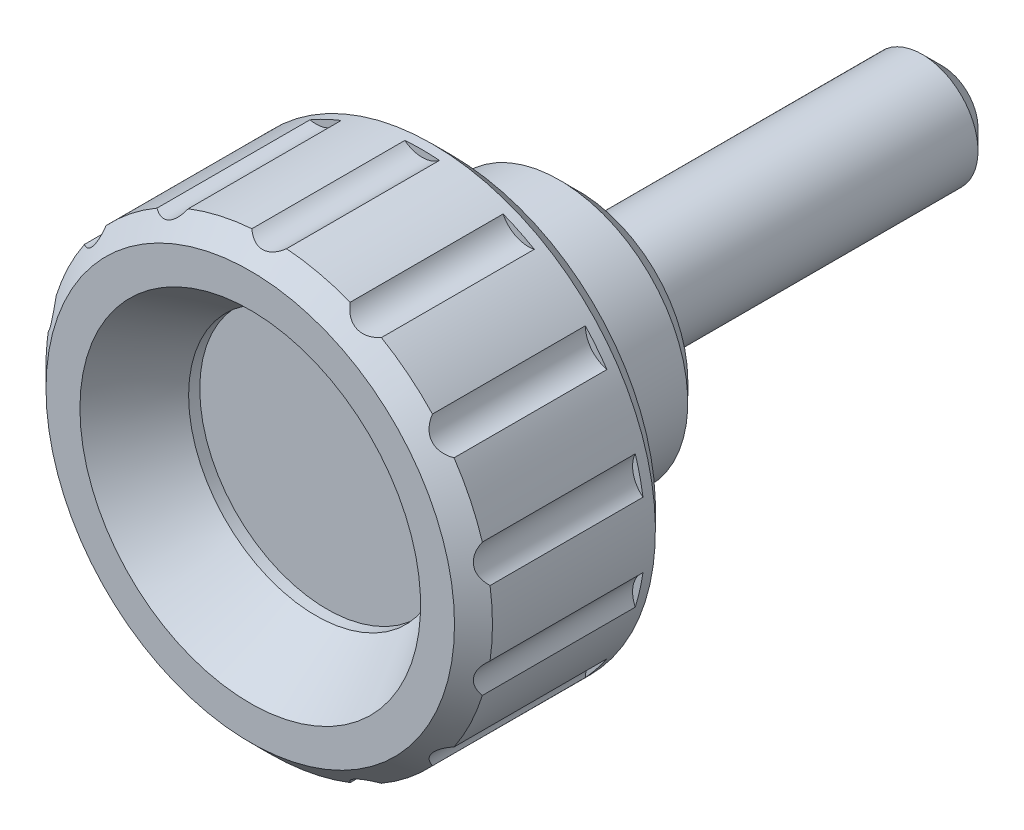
ISO-10303-21;
HEADER;
FILE_DESCRIPTION(('STEP AP214'),'2;1');
FILE_NAME('part.step','',(''),(''),'','','');
FILE_SCHEMA(('AUTOMOTIVE_DESIGN { 1 0 10303 214 1 1 1 1 }'));
ENDSEC;
DATA;
#1=APPLICATION_CONTEXT('core data for automotive mechanical design processes');
#2=APPLICATION_PROTOCOL_DEFINITION('international standard','automotive_design',2000,#1);
#3=PRODUCT_CONTEXT('',#1,'mechanical');
#4=PRODUCT('Part','Part','',(#3));
#5=PRODUCT_RELATED_PRODUCT_CATEGORY('part','',(#4));
#6=PRODUCT_DEFINITION_FORMATION('','',#4);
#7=PRODUCT_DEFINITION_CONTEXT('part definition',#1,'design');
#8=PRODUCT_DEFINITION('design','',#6,#7);
#9=PRODUCT_DEFINITION_SHAPE('','',#8);
#10=(LENGTH_UNIT() NAMED_UNIT(*) SI_UNIT(.MILLI.,.METRE.));
#11=(NAMED_UNIT(*) PLANE_ANGLE_UNIT() SI_UNIT($,.RADIAN.));
#12=(NAMED_UNIT(*) SI_UNIT($,.STERADIAN.) SOLID_ANGLE_UNIT());
#13=UNCERTAINTY_MEASURE_WITH_UNIT(LENGTH_MEASURE(1.E-05),#10,'distance_accuracy_value','');
#14=(GEOMETRIC_REPRESENTATION_CONTEXT(3) GLOBAL_UNCERTAINTY_ASSIGNED_CONTEXT((#13)) GLOBAL_UNIT_ASSIGNED_CONTEXT((#10,
#11,#12)) REPRESENTATION_CONTEXT('',''));
#15=CARTESIAN_POINT('',(0.,0.,0.));
#16=DIRECTION('',(0.,0.,1.));
#17=DIRECTION('',(1.,0.,0.));
#18=AXIS2_PLACEMENT_3D('',#15,#16,#17);
#19=CARTESIAN_POINT('',(3.99999999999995,0.,0.));
#20=DIRECTION('',(0.,0.,-1.));
#21=DIRECTION('',(0.,1.,0.));
#22=AXIS2_PLACEMENT_3D('',#19,#20,#21);
#23=PLANE('',#22);
#24=CARTESIAN_POINT('',(0.,0.,0.));
#25=DIRECTION('',(0.,0.,-1.));
#26=DIRECTION('',(-1.,0.,0.));
#27=AXIS2_PLACEMENT_3D('',#24,#25,#26);
#28=CIRCLE('',#27,3.5);
#29=CARTESIAN_POINT('',(-3.5,0.,0.));
#30=VERTEX_POINT('',#29);
#31=EDGE_CURVE('E276',#30,#30,#28,.F.);
#32=ORIENTED_EDGE('',*,*,#31,.F.);
#33=EDGE_LOOP('',(#32));
#34=FACE_BOUND('',#33,.T.);
#35=CARTESIAN_POINT('',(0.,0.,0.));
#36=DIRECTION('',(0.,0.,-1.));
#37=DIRECTION('',(-1.,0.,0.));
#38=AXIS2_PLACEMENT_3D('',#35,#36,#37);
#39=CIRCLE('',#38,2.5);
#40=CARTESIAN_POINT('',(-2.5,0.,0.));
#41=VERTEX_POINT('',#40);
#42=EDGE_CURVE('E1004',#41,#41,#39,.T.);
#43=ORIENTED_EDGE('',*,*,#42,.F.);
#44=EDGE_LOOP('',(#43));
#45=FACE_BOUND('',#44,.T.);
#46=ADVANCED_FACE('F14',(#34,#45),#23,.T.);
#47=CARTESIAN_POINT('',(0.,0.,0.));
#48=DIRECTION('',(0.,0.,-1.));
#49=DIRECTION('',(0.,1.,0.));
#50=AXIS2_PLACEMENT_3D('',#47,#48,#49);
#51=CYLINDRICAL_SURFACE('',#50,10.);
#52=CARTESIAN_POINT('',(0.,0.,14.15));
#53=DIRECTION('',(0.,0.,-1.));
#54=DIRECTION('',(-1.,0.,0.));
#55=AXIS2_PLACEMENT_3D('',#52,#53,#54);
#56=CIRCLE('',#55,10.);
#57=CARTESIAN_POINT('',(-8.27844244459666,-5.60958025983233,14.15));
#58=VERTEX_POINT('',#57);
#59=CARTESIAN_POINT('',(-9.54727089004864,-2.97483084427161,14.15));
#60=VERTEX_POINT('',#59);
#61=EDGE_CURVE('E227',#58,#60,#56,.T.);
#62=ORIENTED_EDGE('',*,*,#61,.T.);
#63=DIRECTION('',(0.,0.,1.));
#64=VECTOR('',#63,1.);
#65=CARTESIAN_POINT('',(-9.54727089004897,-2.97483084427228,7.3));
#66=LINE('',#65,#64);
#67=CARTESIAN_POINT('',(-9.54727089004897,-2.97483084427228,7.3));
#68=VERTEX_POINT('',#67);
#69=EDGE_CURVE('E235',#68,#60,#66,.T.);
#70=ORIENTED_EDGE('',*,*,#69,.F.);
#71=CARTESIAN_POINT('',(0.,0.,7.3));
#72=DIRECTION('',(0.,0.,1.));
#73=DIRECTION('',(0.,-1.,0.));
#74=AXIS2_PLACEMENT_3D('',#71,#72,#73);
#75=CIRCLE('',#74,10.);
#76=CARTESIAN_POINT('',(-9.89252457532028,-1.46217561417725,7.3));
#77=VERTEX_POINT('',#76);
#78=EDGE_CURVE('E440',#68,#77,#75,.F.);
#79=ORIENTED_EDGE('',*,*,#78,.T.);
#80=DIRECTION('',(0.,0.,1.));
#81=VECTOR('',#80,1.);
#82=CARTESIAN_POINT('',(-9.89252457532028,-1.46217561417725,7.3));
#83=LINE('',#82,#81);
#84=CARTESIAN_POINT('',(-9.89252457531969,-1.46217561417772,14.15));
#85=VERTEX_POINT('',#84);
#86=EDGE_CURVE('E226',#77,#85,#83,.T.);
#87=ORIENTED_EDGE('',*,*,#86,.T.);
#88=CARTESIAN_POINT('',(-9.8925245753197,1.46217561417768,14.15));
#89=VERTEX_POINT('',#88);
#90=EDGE_CURVE('E207',#85,#89,#56,.T.);
#91=ORIENTED_EDGE('',*,*,#90,.T.);
#92=DIRECTION('',(0.,0.,1.));
#93=VECTOR('',#92,1.);
#94=CARTESIAN_POINT('',(-9.89252457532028,1.46217561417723,7.3));
#95=LINE('',#94,#93);
#96=CARTESIAN_POINT('',(-9.89252457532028,1.46217561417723,7.3));
#97=VERTEX_POINT('',#96);
#98=EDGE_CURVE('E224',#97,#89,#95,.T.);
#99=ORIENTED_EDGE('',*,*,#98,.F.);
#100=CARTESIAN_POINT('',(-9.54727089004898,2.97483084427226,7.3));
#101=VERTEX_POINT('',#100);
#102=EDGE_CURVE('E962',#97,#101,#75,.F.);
#103=ORIENTED_EDGE('',*,*,#102,.T.);
#104=DIRECTION('',(0.,0.,1.));
#105=VECTOR('',#104,1.);
#106=CARTESIAN_POINT('',(-9.54727089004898,2.97483084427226,7.3));
#107=LINE('',#106,#105);
#108=CARTESIAN_POINT('',(-9.54727089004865,2.97483084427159,14.15));
#109=VERTEX_POINT('',#108);
#110=EDGE_CURVE('E233',#101,#109,#107,.T.);
#111=ORIENTED_EDGE('',*,*,#110,.T.);
#112=CARTESIAN_POINT('',(-8.27844244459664,5.60958025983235,14.15));
#113=VERTEX_POINT('',#112);
#114=EDGE_CURVE('E210',#109,#113,#56,.T.);
#115=ORIENTED_EDGE('',*,*,#114,.T.);
#116=DIRECTION('',(0.,0.,1.));
#117=VECTOR('',#116,1.);
#118=CARTESIAN_POINT('',(-8.27844244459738,5.60958025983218,7.3));
#119=LINE('',#118,#117);
#120=CARTESIAN_POINT('',(-8.27844244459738,5.60958025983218,7.3));
#121=VERTEX_POINT('',#120);
#122=EDGE_CURVE('E237',#121,#113,#119,.T.);
#123=ORIENTED_EDGE('',*,*,#122,.F.);
#124=CARTESIAN_POINT('',(-7.31106311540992,6.82263557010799,7.3));
#125=VERTEX_POINT('',#124);
#126=EDGE_CURVE('E963',#121,#125,#75,.F.);
#127=ORIENTED_EDGE('',*,*,#126,.T.);
#128=DIRECTION('',(0.,0.,1.));
#129=VECTOR('',#128,1.);
#130=CARTESIAN_POINT('',(-7.31106311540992,6.82263557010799,7.3));
#131=LINE('',#130,#129);
#132=CARTESIAN_POINT('',(-7.31106311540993,6.82263557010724,14.15));
#133=VERTEX_POINT('',#132);
#134=EDGE_CURVE('E243',#125,#133,#131,.T.);
#135=ORIENTED_EDGE('',*,*,#134,.T.);
#136=CARTESIAN_POINT('',(-5.02471325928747,8.64593873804,14.15));
#137=VERTEX_POINT('',#136);
#138=EDGE_CURVE('E972',#133,#137,#56,.T.);
#139=ORIENTED_EDGE('',*,*,#138,.T.);
#140=DIRECTION('',(0.,0.,1.));
#141=VECTOR('',#140,1.);
#142=CARTESIAN_POINT('',(-5.02471325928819,8.64593873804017,7.3));
#143=LINE('',#142,#141);
#144=CARTESIAN_POINT('',(-5.02471325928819,8.64593873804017,7.3));
#145=VERTEX_POINT('',#144);
#146=EDGE_CURVE('E246',#145,#137,#143,.T.);
#147=ORIENTED_EDGE('',*,*,#146,.F.);
#148=CARTESIAN_POINT('',(-3.62680962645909,9.3191336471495,7.3));
#149=VERTEX_POINT('',#148);
#150=EDGE_CURVE('E267',#145,#149,#75,.F.);
#151=ORIENTED_EDGE('',*,*,#150,.T.);
#152=DIRECTION('',(0.,0.,1.));
#153=VECTOR('',#152,1.);
#154=CARTESIAN_POINT('',(-3.62680962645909,9.3191336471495,7.3));
#155=LINE('',#154,#153);
#156=CARTESIAN_POINT('',(-3.62680962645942,9.31913364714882,14.15));
#157=VERTEX_POINT('',#156);
#158=EDGE_CURVE('E249',#149,#157,#155,.T.);
#159=ORIENTED_EDGE('',*,*,#158,.T.);
#160=CARTESIAN_POINT('',(-0.775777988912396,9.96986301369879,14.15));
#161=VERTEX_POINT('',#160);
#162=EDGE_CURVE('E974',#157,#161,#56,.T.);
#163=ORIENTED_EDGE('',*,*,#162,.T.);
#164=DIRECTION('',(0.,0.,1.));
#165=VECTOR('',#164,1.);
#166=CARTESIAN_POINT('',(-0.775777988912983,9.96986301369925,7.3));
#167=LINE('',#166,#165);
#168=CARTESIAN_POINT('',(-0.775777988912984,9.96986301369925,7.3));
#169=VERTEX_POINT('',#168);
#170=EDGE_CURVE('E252',#169,#161,#167,.T.);
#171=ORIENTED_EDGE('',*,*,#170,.F.);
#172=CARTESIAN_POINT('',(0.775777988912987,9.96986301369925,7.3));
#173=VERTEX_POINT('',#172);
#174=EDGE_CURVE('E41',#169,#173,#75,.F.);
#175=ORIENTED_EDGE('',*,*,#174,.T.);
#176=DIRECTION('',(0.,0.,1.));
#177=VECTOR('',#176,1.);
#178=CARTESIAN_POINT('',(0.775777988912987,9.96986301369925,7.3));
#179=LINE('',#178,#177);
#180=CARTESIAN_POINT('',(0.775777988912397,9.96986301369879,14.15));
#181=VERTEX_POINT('',#180);
#182=EDGE_CURVE('E255',#173,#181,#179,.T.);
#183=ORIENTED_EDGE('',*,*,#182,.T.);
#184=CARTESIAN_POINT('',(3.62680962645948,9.3191336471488,14.15));
#185=VERTEX_POINT('',#184);
#186=EDGE_CURVE('E975',#181,#185,#56,.T.);
#187=ORIENTED_EDGE('',*,*,#186,.T.);
#188=DIRECTION('',(0.,0.,1.));
#189=VECTOR('',#188,1.);
#190=CARTESIAN_POINT('',(3.62680962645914,9.31913364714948,7.3));
#191=LINE('',#190,#189);
#192=CARTESIAN_POINT('',(3.62680962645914,9.31913364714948,7.3));
#193=VERTEX_POINT('',#192);
#194=EDGE_CURVE('E263',#193,#185,#191,.T.);
#195=ORIENTED_EDGE('',*,*,#194,.F.);
#196=CARTESIAN_POINT('',(5.02471325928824,8.64593873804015,7.3));
#197=VERTEX_POINT('',#196);
#198=EDGE_CURVE('E268',#193,#197,#75,.F.);
#199=ORIENTED_EDGE('',*,*,#198,.T.);
#200=DIRECTION('',(0.,0.,1.));
#201=VECTOR('',#200,1.);
#202=CARTESIAN_POINT('',(5.02471325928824,8.64593873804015,7.3));
#203=LINE('',#202,#201);
#204=CARTESIAN_POINT('',(5.02471325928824,8.64593873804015,14.15));
#205=VERTEX_POINT('',#204);
#206=EDGE_CURVE('E385',#197,#205,#203,.T.);
#207=ORIENTED_EDGE('',*,*,#206,.T.);
#208=CARTESIAN_POINT('',(7.31106311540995,6.82263557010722,14.15));
#209=VERTEX_POINT('',#208);
#210=EDGE_CURVE('E34',#205,#209,#56,.T.);
#211=ORIENTED_EDGE('',*,*,#210,.T.);
#212=DIRECTION('',(0.,0.,1.));
#213=VECTOR('',#212,1.);
#214=CARTESIAN_POINT('',(7.31106311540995,6.82263557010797,7.3));
#215=LINE('',#214,#213);
#216=CARTESIAN_POINT('',(7.31106311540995,6.82263557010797,7.3));
#217=VERTEX_POINT('',#216);
#218=EDGE_CURVE('E388',#217,#209,#215,.T.);
#219=ORIENTED_EDGE('',*,*,#218,.F.);
#220=CARTESIAN_POINT('',(8.27844244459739,5.60958025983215,7.3));
#221=VERTEX_POINT('',#220);
#222=EDGE_CURVE('E940',#217,#221,#75,.F.);
#223=ORIENTED_EDGE('',*,*,#222,.T.);
#224=DIRECTION('',(0.,0.,1.));
#225=VECTOR('',#224,1.);
#226=CARTESIAN_POINT('',(8.27844244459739,5.60958025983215,7.3));
#227=LINE('',#226,#225);
#228=CARTESIAN_POINT('',(8.27844244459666,5.60958025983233,14.15));
#229=VERTEX_POINT('',#228);
#230=EDGE_CURVE('E391',#221,#229,#227,.T.);
#231=ORIENTED_EDGE('',*,*,#230,.T.);
#232=CARTESIAN_POINT('',(9.54727089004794,2.97483084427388,14.15));
#233=VERTEX_POINT('',#232);
#234=EDGE_CURVE('E977',#229,#233,#56,.T.);
#235=ORIENTED_EDGE('',*,*,#234,.T.);
#236=DIRECTION('',(0.,0.,1.));
#237=VECTOR('',#236,1.);
#238=CARTESIAN_POINT('',(9.54727089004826,2.97483084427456,7.3));
#239=LINE('',#238,#237);
#240=CARTESIAN_POINT('',(9.54727089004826,2.97483084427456,7.3));
#241=VERTEX_POINT('',#240);
#242=EDGE_CURVE('E394',#241,#233,#239,.T.);
#243=ORIENTED_EDGE('',*,*,#242,.F.);
#244=CARTESIAN_POINT('',(9.89252457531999,1.46217561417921,7.3));
#245=VERTEX_POINT('',#244);
#246=EDGE_CURVE('E942',#241,#245,#75,.F.);
#247=ORIENTED_EDGE('',*,*,#246,.T.);
#248=DIRECTION('',(0.,0.,1.));
#249=VECTOR('',#248,1.);
#250=CARTESIAN_POINT('',(9.89252457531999,1.46217561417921,7.3));
#251=LINE('',#250,#249);
#252=CARTESIAN_POINT('',(9.8925245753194,1.46217561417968,14.15));
#253=VERTEX_POINT('',#252);
#254=EDGE_CURVE('E397',#245,#253,#251,.T.);
#255=ORIENTED_EDGE('',*,*,#254,.T.);
#256=CARTESIAN_POINT('',(9.89252457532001,-1.46217561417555,14.15));
#257=VERTEX_POINT('',#256);
#258=EDGE_CURVE('E979',#253,#257,#56,.T.);
#259=ORIENTED_EDGE('',*,*,#258,.T.);
#260=DIRECTION('',(0.,0.,1.));
#261=VECTOR('',#260,1.);
#262=CARTESIAN_POINT('',(9.8925245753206,-1.46217561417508,7.3));
#263=LINE('',#262,#261);
#264=CARTESIAN_POINT('',(9.8925245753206,-1.46217561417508,7.3));
#265=VERTEX_POINT('',#264);
#266=EDGE_CURVE('E400',#265,#257,#263,.T.);
#267=ORIENTED_EDGE('',*,*,#266,.F.);
#268=CARTESIAN_POINT('',(9.54727089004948,-2.97483084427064,7.3));
#269=VERTEX_POINT('',#268);
#270=EDGE_CURVE('E944',#265,#269,#75,.F.);
#271=ORIENTED_EDGE('',*,*,#270,.T.);
#272=DIRECTION('',(0.,0.,1.));
#273=VECTOR('',#272,1.);
#274=CARTESIAN_POINT('',(9.54727089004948,-2.97483084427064,7.3));
#275=LINE('',#274,#273);
#276=CARTESIAN_POINT('',(9.54727089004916,-2.97483084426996,14.15));
#277=VERTEX_POINT('',#276);
#278=EDGE_CURVE('E403',#269,#277,#275,.T.);
#279=ORIENTED_EDGE('',*,*,#278,.T.);
#280=CARTESIAN_POINT('',(8.27844244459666,-5.60958025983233,14.15));
#281=VERTEX_POINT('',#280);
#282=EDGE_CURVE('E981',#277,#281,#56,.T.);
#283=ORIENTED_EDGE('',*,*,#282,.T.);
#284=DIRECTION('',(0.,0.,1.));
#285=VECTOR('',#284,1.);
#286=CARTESIAN_POINT('',(8.27844244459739,-5.60958025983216,7.3));
#287=LINE('',#286,#285);
#288=CARTESIAN_POINT('',(8.27844244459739,-5.60958025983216,7.3));
#289=VERTEX_POINT('',#288);
#290=EDGE_CURVE('E406',#289,#281,#287,.T.);
#291=ORIENTED_EDGE('',*,*,#290,.F.);
#292=CARTESIAN_POINT('',(7.31106311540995,-6.82263557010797,7.3));
#293=VERTEX_POINT('',#292);
#294=EDGE_CURVE('E947',#289,#293,#75,.F.);
#295=ORIENTED_EDGE('',*,*,#294,.T.);
#296=DIRECTION('',(0.,0.,1.));
#297=VECTOR('',#296,1.);
#298=CARTESIAN_POINT('',(7.31106311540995,-6.82263557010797,7.3));
#299=LINE('',#298,#297);
#300=CARTESIAN_POINT('',(7.31106311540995,-6.82263557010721,14.15));
#301=VERTEX_POINT('',#300);
#302=EDGE_CURVE('E409',#293,#301,#299,.T.);
#303=ORIENTED_EDGE('',*,*,#302,.T.);
#304=CARTESIAN_POINT('',(5.02471325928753,-8.64593873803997,14.15));
#305=VERTEX_POINT('',#304);
#306=EDGE_CURVE('E983',#301,#305,#56,.T.);
#307=ORIENTED_EDGE('',*,*,#306,.T.);
#308=DIRECTION('',(0.,0.,1.));
#309=VECTOR('',#308,1.);
#310=CARTESIAN_POINT('',(5.02471325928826,-8.64593873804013,7.3));
#311=LINE('',#310,#309);
#312=CARTESIAN_POINT('',(5.02471325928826,-8.64593873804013,7.3));
#313=VERTEX_POINT('',#312);
#314=EDGE_CURVE('E412',#313,#305,#311,.T.);
#315=ORIENTED_EDGE('',*,*,#314,.F.);
#316=CARTESIAN_POINT('',(3.62680962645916,-9.31913364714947,7.3));
#317=VERTEX_POINT('',#316);
#318=EDGE_CURVE('E950',#313,#317,#75,.F.);
#319=ORIENTED_EDGE('',*,*,#318,.T.);
#320=DIRECTION('',(0.,0.,1.));
#321=VECTOR('',#320,1.);
#322=CARTESIAN_POINT('',(3.62680962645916,-9.31913364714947,7.3));
#323=LINE('',#322,#321);
#324=CARTESIAN_POINT('',(3.62680962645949,-9.31913364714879,14.15));
#325=VERTEX_POINT('',#324);
#326=EDGE_CURVE('E415',#317,#325,#323,.T.);
#327=ORIENTED_EDGE('',*,*,#326,.T.);
#328=CARTESIAN_POINT('',(0.775777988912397,-9.96986301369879,14.15));
#329=VERTEX_POINT('',#328);
#330=EDGE_CURVE('E985',#325,#329,#56,.T.);
#331=ORIENTED_EDGE('',*,*,#330,.T.);
#332=DIRECTION('',(0.,0.,1.));
#333=VECTOR('',#332,1.);
#334=CARTESIAN_POINT('',(0.775777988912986,-9.96986301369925,7.3));
#335=LINE('',#334,#333);
#336=CARTESIAN_POINT('',(0.775777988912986,-9.96986301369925,7.3));
#337=VERTEX_POINT('',#336);
#338=EDGE_CURVE('E418',#337,#329,#335,.T.);
#339=ORIENTED_EDGE('',*,*,#338,.F.);
#340=CARTESIAN_POINT('',(-0.775777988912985,-9.96986301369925,7.3));
#341=VERTEX_POINT('',#340);
#342=EDGE_CURVE('E953',#337,#341,#75,.F.);
#343=ORIENTED_EDGE('',*,*,#342,.T.);
#344=DIRECTION('',(0.,0.,1.));
#345=VECTOR('',#344,1.);
#346=CARTESIAN_POINT('',(-0.775777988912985,-9.96986301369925,7.3));
#347=LINE('',#346,#345);
#348=CARTESIAN_POINT('',(-0.775777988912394,-9.96986301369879,14.15));
#349=VERTEX_POINT('',#348);
#350=EDGE_CURVE('E421',#341,#349,#347,.T.);
#351=ORIENTED_EDGE('',*,*,#350,.T.);
#352=CARTESIAN_POINT('',(-3.62680962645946,-9.3191336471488,14.15));
#353=VERTEX_POINT('',#352);
#354=EDGE_CURVE('E445',#349,#353,#56,.T.);
#355=ORIENTED_EDGE('',*,*,#354,.T.);
#356=DIRECTION('',(0.,0.,1.));
#357=VECTOR('',#356,1.);
#358=CARTESIAN_POINT('',(-3.62680962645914,-9.31913364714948,7.3));
#359=LINE('',#358,#357);
#360=CARTESIAN_POINT('',(-3.62680962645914,-9.31913364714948,7.3));
#361=VERTEX_POINT('',#360);
#362=EDGE_CURVE('E424',#361,#353,#359,.T.);
#363=ORIENTED_EDGE('',*,*,#362,.F.);
#364=CARTESIAN_POINT('',(-5.02471325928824,-8.64593873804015,7.3));
#365=VERTEX_POINT('',#364);
#366=EDGE_CURVE('E956',#361,#365,#75,.F.);
#367=ORIENTED_EDGE('',*,*,#366,.T.);
#368=DIRECTION('',(0.,0.,1.));
#369=VECTOR('',#368,1.);
#370=CARTESIAN_POINT('',(-5.02471325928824,-8.64593873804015,7.3));
#371=LINE('',#370,#369);
#372=CARTESIAN_POINT('',(-5.02471325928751,-8.64593873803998,14.15));
#373=VERTEX_POINT('',#372);
#374=EDGE_CURVE('E427',#365,#373,#371,.T.);
#375=ORIENTED_EDGE('',*,*,#374,.T.);
#376=CARTESIAN_POINT('',(-7.31106311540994,-6.82263557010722,14.15));
#377=VERTEX_POINT('',#376);
#378=EDGE_CURVE('E443',#373,#377,#56,.T.);
#379=ORIENTED_EDGE('',*,*,#378,.T.);
#380=DIRECTION('',(0.,0.,1.));
#381=VECTOR('',#380,1.);
#382=CARTESIAN_POINT('',(-7.31106311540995,-6.82263557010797,7.3));
#383=LINE('',#382,#381);
#384=CARTESIAN_POINT('',(-7.31106311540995,-6.82263557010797,7.3));
#385=VERTEX_POINT('',#384);
#386=EDGE_CURVE('E430',#385,#377,#383,.T.);
#387=ORIENTED_EDGE('',*,*,#386,.F.);
#388=CARTESIAN_POINT('',(-8.27844244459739,-5.60958025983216,7.3));
#389=VERTEX_POINT('',#388);
#390=EDGE_CURVE('E959',#385,#389,#75,.F.);
#391=ORIENTED_EDGE('',*,*,#390,.T.);
#392=DIRECTION('',(0.,0.,1.));
#393=VECTOR('',#392,1.);
#394=CARTESIAN_POINT('',(-8.27844244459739,-5.60958025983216,7.3));
#395=LINE('',#394,#393);
#396=EDGE_CURVE('E433',#389,#58,#395,.T.);
#397=ORIENTED_EDGE('',*,*,#396,.T.);
#398=EDGE_LOOP('',(#62,#70,#79,#87,#91,#99,#103,#111,#115,#123,#127,#135,#139,#147,#151,#159,
#163,#171,#175,#183,#187,#195,#199,#207,#211,#219,#223,#231,#235,#243,#247,#255,#259,#267,#271,
#279,#283,#291,#295,#303,#307,#315,#319,#327,#331,#339,#343,#351,#355,#363,#367,#375,#379,#387,
#391,#397));
#399=FACE_BOUND('',#398,.T.);
#400=CARTESIAN_POINT('',(0.,0.,6.85));
#401=DIRECTION('',(0.,0.,-1.));
#402=DIRECTION('',(0.,1.,0.));
#403=AXIS2_PLACEMENT_3D('',#400,#401,#402);
#404=CIRCLE('',#403,10.);
#405=CARTESIAN_POINT('',(0.,10.,6.85));
#406=VERTEX_POINT('',#405);
#407=EDGE_CURVE('E259',#406,#406,#404,.T.);
#408=ORIENTED_EDGE('',*,*,#407,.F.);
#409=EDGE_LOOP('',(#408));
#410=FACE_BOUND('',#409,.T.);
#411=ADVANCED_FACE('F221',(#399,#410),#51,.T.);
#412=CARTESIAN_POINT('',(9.15,0.,6.));
#413=DIRECTION('',(0.,0.,-1.));
#414=DIRECTION('',(0.,1.,0.));
#415=AXIS2_PLACEMENT_3D('',#412,#413,#414);
#416=PLANE('',#415);
#417=CARTESIAN_POINT('',(0.,0.,6.));
#418=DIRECTION('',(0.,0.,-1.));
#419=DIRECTION('',(0.,1.,0.));
#420=AXIS2_PLACEMENT_3D('',#417,#418,#419);
#421=CIRCLE('',#420,9.15);
#422=CARTESIAN_POINT('',(0.,9.15,6.));
#423=VERTEX_POINT('',#422);
#424=EDGE_CURVE('E262',#423,#423,#421,.T.);
#425=ORIENTED_EDGE('',*,*,#424,.T.);
#426=EDGE_LOOP('',(#425));
#427=FACE_BOUND('',#426,.T.);
#428=CARTESIAN_POINT('',(0.,0.,6.));
#429=DIRECTION('',(0.,0.,-1.));
#430=DIRECTION('',(-1.,0.,0.));
#431=AXIS2_PLACEMENT_3D('',#428,#429,#430);
#432=CIRCLE('',#431,5.75);
#433=CARTESIAN_POINT('',(-5.75,0.,6.));
#434=VERTEX_POINT('',#433);
#435=EDGE_CURVE('E279',#434,#434,#432,.T.);
#436=ORIENTED_EDGE('',*,*,#435,.F.);
#437=EDGE_LOOP('',(#436));
#438=FACE_BOUND('',#437,.T.);
#439=ADVANCED_FACE('F311',(#427,#438),#416,.T.);
#440=CARTESIAN_POINT('',(0.,0.,6.));
#441=DIRECTION('',(0.,0.,1.));
#442=DIRECTION('',(0.,-1.,0.));
#443=AXIS2_PLACEMENT_3D('',#440,#441,#442);
#444=CONICAL_SURFACE('',#443,9.15,0.785398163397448);
#445=ORIENTED_EDGE('',*,*,#407,.T.);
#446=EDGE_LOOP('',(#445));
#447=FACE_BOUND('',#446,.T.);
#448=ORIENTED_EDGE('',*,*,#424,.F.);
#449=EDGE_LOOP('',(#448));
#450=FACE_BOUND('',#449,.T.);
#451=ADVANCED_FACE('F577',(#447,#450),#444,.T.);
#452=CARTESIAN_POINT('',(0.,10.9500000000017,7.3));
#453=DIRECTION('',(0.,0.,1.));
#454=DIRECTION('',(0.,-1.,0.));
#455=AXIS2_PLACEMENT_3D('',#452,#453,#454);
#456=CYLINDRICAL_SURFACE('',#455,1.25);
#457=CARTESIAN_POINT('',(0.775977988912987,9.97002134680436,14.1498266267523));
#458=CARTESIAN_POINT('',(0.734586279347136,9.93724261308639,14.1857107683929));
#459=CARTESIAN_POINT('',(0.68995529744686,9.90618033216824,14.2199249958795));
#460=CARTESIAN_POINT('',(0.593942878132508,9.84868428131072,14.2835331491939));
#461=CARTESIAN_POINT('',(0.542499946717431,9.82229852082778,14.3128768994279));
#462=CARTESIAN_POINT('',(0.443151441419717,9.78017982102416,14.3598826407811));
#463=CARTESIAN_POINT('',(0.396256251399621,9.76338583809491,14.3786950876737));
#464=CARTESIAN_POINT('',(0.299067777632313,9.73525526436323,14.4102700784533));
#465=CARTESIAN_POINT('',(0.248787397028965,9.7238991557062,14.4230542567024));
#466=CARTESIAN_POINT('',(0.145474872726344,9.70738511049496,14.4416620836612));
#467=CARTESIAN_POINT('',(0.0924231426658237,9.70228010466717,14.4474262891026));
#468=CARTESIAN_POINT('',(-0.0142000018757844,9.69894396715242,14.4511919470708));
#469=CARTESIAN_POINT('',(-0.0677715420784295,9.70071454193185,14.4491914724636));
#470=CARTESIAN_POINT('',(-0.167200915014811,9.71034496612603,14.4383278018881));
#471=CARTESIAN_POINT('',(-0.213227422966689,9.71746747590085,14.4302956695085));
#472=CARTESIAN_POINT('',(-0.30302476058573,9.7364164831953,14.4089716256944));
#473=CARTESIAN_POINT('',(-0.346794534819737,9.74824515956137,14.3956772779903));
#474=CARTESIAN_POINT('',(-0.445997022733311,9.78073865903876,14.3592589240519));
#475=CARTESIAN_POINT('',(-0.500224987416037,9.80304471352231,14.3343253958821));
#476=CARTESIAN_POINT('',(-0.602533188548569,9.8533143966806,14.2784064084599));
#477=CARTESIAN_POINT('',(-0.650605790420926,9.88128494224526,14.2474135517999));
#478=CARTESIAN_POINT('',(-0.723578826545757,9.93016500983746,14.1935419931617));
#479=CARTESIAN_POINT('',(-0.750378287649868,9.94975642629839,14.1720143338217));
#480=CARTESIAN_POINT('',(-0.775977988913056,9.97002134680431,14.1498266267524));
#481=B_SPLINE_CURVE_WITH_KNOTS('',3,(#457,#458,#459,#460,#461,#462,#463,#464,#465,#466,#467,
#468,#469,#470,#471,#472,#473,#474,#475,#476,#477,#478,#479,#480),.UNSPECIFIED.,.F.,.F.,(4,2,2,
2,2,2,2,2,2,2,2,4),(0.,0.191836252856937,0.385540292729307,0.544632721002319,0.703149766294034,
0.86299996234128,1.022889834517,1.16405643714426,1.3052884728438,1.49538818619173,
1.68572144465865,1.80423553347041),.UNSPECIFIED.);
#482=EDGE_CURVE('E559',#181,#161,#481,.T.);
#483=ORIENTED_EDGE('',*,*,#482,.F.);
#484=ORIENTED_EDGE('',*,*,#182,.F.);
#485=CARTESIAN_POINT('',(0.,10.9500000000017,7.3));
#486=DIRECTION('',(0.,0.,-1.));
#487=DIRECTION('',(0.,-1.,0.));
#488=AXIS2_PLACEMENT_3D('',#485,#486,#487);
#489=CIRCLE('',#488,1.25);
#490=EDGE_CURVE('E341',#173,#169,#489,.T.);
#491=ORIENTED_EDGE('',*,*,#490,.T.);
#492=ORIENTED_EDGE('',*,*,#170,.T.);
#493=EDGE_LOOP('',(#483,#484,#491,#492));
#494=FACE_BOUND('',#493,.T.);
#495=ADVANCED_FACE('F573',(#494),#456,.F.);
#496=CARTESIAN_POINT('',(0.,0.,7.3));
#497=DIRECTION('',(0.,0.,1.));
#498=DIRECTION('',(0.,-1.,0.));
#499=AXIS2_PLACEMENT_3D('',#496,#497,#498);
#500=PLANE('',#499);
#501=ORIENTED_EDGE('',*,*,#490,.F.);
#502=ORIENTED_EDGE('',*,*,#174,.F.);
#503=EDGE_LOOP('',(#501,#502));
#504=FACE_BOUND('',#503,.T.);
#505=ADVANCED_FACE('F569',(#504),#500,.T.);
#506=CARTESIAN_POINT('',(-4.75102694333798,9.86560910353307,7.3));
#507=DIRECTION('',(0.,0.,1.));
#508=DIRECTION('',(0.,-1.,0.));
#509=AXIS2_PLACEMENT_3D('',#506,#507,#508);
#510=CYLINDRICAL_SURFACE('',#509,1.25);
#511=CARTESIAN_POINT('',(-3.62668101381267,9.31939831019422,14.1498));
#512=CARTESIAN_POINT('',(-3.64975063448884,9.27190450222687,14.185686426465));
#513=CARTESIAN_POINT('',(-3.67648365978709,9.22455160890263,14.2199029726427));
#514=CARTESIAN_POINT('',(-3.73804039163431,9.13108688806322,14.2835157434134));
#515=CARTESIAN_POINT('',(-3.77294034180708,9.08499163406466,14.3128617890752));
#516=CARTESIAN_POINT('',(-3.84417515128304,9.00393496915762,14.3598710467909));
#517=CARTESIAN_POINT('',(-3.87913908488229,8.96845594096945,14.3786848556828));
#518=CARTESIAN_POINT('',(-3.95449665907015,8.90094031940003,14.4102625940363));
#519=CARTESIAN_POINT('',(-3.99487020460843,8.86889173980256,14.4230481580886));
#520=CARTESIAN_POINT('',(-4.08078621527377,8.80918487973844,14.4416586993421));
#521=CARTESIAN_POINT('',(-4.12636930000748,8.78156579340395,14.447424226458));
#522=CARTESIAN_POINT('',(-4.2209865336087,8.73229533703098,14.4511922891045));
#523=CARTESIAN_POINT('',(-4.27002153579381,8.71064544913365,14.4491928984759));
#524=CARTESIAN_POINT('',(-4.36378339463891,8.67617932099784,14.4383310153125));
#525=CARTESIAN_POINT('',(-4.4083422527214,8.66262548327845,14.4302997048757));
#526=CARTESIAN_POINT('',(-4.49746880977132,8.64073471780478,14.408977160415));
#527=CARTESIAN_POINT('',(-4.54203650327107,8.63240020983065,14.3956834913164));
#528=CARTESIAN_POINT('',(-4.64551253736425,8.61863194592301,14.35926702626));
#529=CARTESIAN_POINT('',(-4.70404762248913,8.61519944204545,14.3343348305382));
#530=CARTESIAN_POINT('',(-4.81803389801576,8.6160989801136,14.2784184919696));
#531=CARTESIAN_POINT('',(-4.87348120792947,8.62044057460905,14.2474269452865));
#532=CARTESIAN_POINT('',(-4.96045702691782,8.63281949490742,14.1935439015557));
#533=CARTESIAN_POINT('',(-4.99312357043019,8.63884697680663,14.1720023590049));
#534=CARTESIAN_POINT('',(-5.02500036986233,8.6460031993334,14.1498));
#535=B_SPLINE_CURVE_WITH_KNOTS('',3,(#511,#512,#513,#514,#515,#516,#517,#518,#519,#520,#521,
#522,#523,#524,#525,#526,#527,#528,#529,#530,#531,#532,#533,#534),.UNSPECIFIED.,.F.,.F.,(4,2,2,
2,2,2,2,2,2,2,2,4),(0.,0.191843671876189,0.385555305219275,0.544650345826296,0.70316998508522,
0.863022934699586,1.02291553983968,1.16408261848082,1.305315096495,1.49541104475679,
1.68574073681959,1.80433015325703),.UNSPECIFIED.);
#536=EDGE_CURVE('E553',#157,#137,#535,.T.);
#537=ORIENTED_EDGE('',*,*,#536,.F.);
#538=ORIENTED_EDGE('',*,*,#158,.F.);
#539=CARTESIAN_POINT('',(-4.75102694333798,9.86560910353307,7.3));
#540=DIRECTION('',(0.,0.,-1.));
#541=DIRECTION('',(0.,-1.,0.));
#542=AXIS2_PLACEMENT_3D('',#539,#540,#541);
#543=CIRCLE('',#542,1.25);
#544=EDGE_CURVE('E343',#149,#145,#543,.T.);
#545=ORIENTED_EDGE('',*,*,#544,.T.);
#546=ORIENTED_EDGE('',*,*,#146,.T.);
#547=EDGE_LOOP('',(#537,#538,#545,#546));
#548=FACE_BOUND('',#547,.T.);
#549=ADVANCED_FACE('F565',(#548),#510,.F.);
#550=ORIENTED_EDGE('',*,*,#544,.F.);
#551=ORIENTED_EDGE('',*,*,#150,.F.);
#552=EDGE_LOOP('',(#550,#551));
#553=FACE_BOUND('',#552,.T.);
#554=ADVANCED_FACE('F568',(#553),#500,.T.);
#555=CARTESIAN_POINT('',(-8.56105473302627,6.82721333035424,7.3));
#556=DIRECTION('',(0.,0.,1.));
#557=DIRECTION('',(0.,-1.,0.));
#558=AXIS2_PLACEMENT_3D('',#555,#556,#557);
#559=CYLINDRICAL_SURFACE('',#558,1.25);
#560=CARTESIAN_POINT('',(-7.31106207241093,6.82292982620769,14.1498));
#561=CARTESIAN_POINT('',(-7.31124029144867,6.77012985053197,14.185686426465));
#562=CARTESIAN_POINT('',(-7.31478026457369,6.7158673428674,14.2199029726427));
#563=CARTESIAN_POINT('',(-7.32968814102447,6.60495007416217,14.2835157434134));
#564=CARTESIAN_POINT('',(-7.34113192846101,6.54827716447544,14.3128617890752));
#565=CARTESIAN_POINT('',(-7.37014310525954,6.44434000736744,14.3598710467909));
#566=CARTESIAN_POINT('',(-7.38625074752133,6.39720422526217,14.3786848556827));
#567=CARTESIAN_POINT('',(-7.42485164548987,6.30367832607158,14.4102625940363));
#568=CARTESIAN_POINT('',(-7.44732159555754,6.25728612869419,14.4230481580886));
#569=CARTESIAN_POINT('',(-7.4988234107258,6.16621454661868,14.4416586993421));
#570=CARTESIAN_POINT('',(-7.52790887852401,6.1215528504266,14.447424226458));
#571=CARTESIAN_POINT('',(-7.59177841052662,6.03610882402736,14.4511922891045));
#572=CARTESIAN_POINT('',(-7.62656388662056,5.99532745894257,14.449192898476));
#573=CARTESIAN_POINT('',(-7.69608610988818,5.92359280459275,14.4383310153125));
#574=CARTESIAN_POINT('',(-7.73035146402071,5.89204785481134,14.4302997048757));
#575=CARTESIAN_POINT('',(-7.80115367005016,5.83365439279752,14.408977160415));
#576=CARTESIAN_POINT('',(-7.83769156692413,5.80680806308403,14.3956834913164));
#577=CARTESIAN_POINT('',(-7.92494642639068,5.74950671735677,14.35926702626));
#578=CARTESIAN_POINT('',(-7.97619540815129,5.72101671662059,14.3343348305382));
#579=CARTESIAN_POINT('',(-8.07928378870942,5.67237038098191,14.2784184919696));
#580=CARTESIAN_POINT('',(-8.13112383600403,5.65222433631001,14.2474269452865));
#581=CARTESIAN_POINT('',(-8.21485735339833,5.62563996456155,14.1935439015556));
#582=CARTESIAN_POINT('',(-8.24690411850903,5.61689705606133,14.1720023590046));
#583=CARTESIAN_POINT('',(-8.27872909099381,5.60951376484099,14.1497999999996));
#584=B_SPLINE_CURVE_WITH_KNOTS('',3,(#560,#561,#562,#563,#564,#565,#566,#567,#568,#569,#570,
#571,#572,#573,#574,#575,#576,#577,#578,#579,#580,#581,#582,#583),.UNSPECIFIED.,.F.,.F.,(4,2,2,
2,2,2,2,2,2,2,2,4),(0.,0.191843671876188,0.385555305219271,0.544650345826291,0.703169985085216,
0.863022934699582,1.02291553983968,1.16408261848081,1.30531509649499,1.49541104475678,
1.68574073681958,1.80433015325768),.UNSPECIFIED.);
#585=EDGE_CURVE('E214',#133,#113,#584,.T.);
#586=ORIENTED_EDGE('',*,*,#585,.F.);
#587=ORIENTED_EDGE('',*,*,#134,.F.);
#588=CARTESIAN_POINT('',(-8.56105473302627,6.82721333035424,7.3));
#589=DIRECTION('',(0.,0.,-1.));
#590=DIRECTION('',(0.,-1.,0.));
#591=AXIS2_PLACEMENT_3D('',#588,#589,#590);
#592=CIRCLE('',#591,1.25);
#593=EDGE_CURVE('E350',#125,#121,#592,.T.);
#594=ORIENTED_EDGE('',*,*,#593,.T.);
#595=ORIENTED_EDGE('',*,*,#122,.T.);
#596=EDGE_LOOP('',(#586,#587,#594,#595));
#597=FACE_BOUND('',#596,.T.);
#598=ADVANCED_FACE('F571',(#597),#559,.F.);
#599=ORIENTED_EDGE('',*,*,#593,.F.);
#600=ORIENTED_EDGE('',*,*,#126,.F.);
#601=EDGE_LOOP('',(#599,#600));
#602=FACE_BOUND('',#601,.T.);
#603=ADVANCED_FACE('F635',(#602),#500,.T.);
#604=CARTESIAN_POINT('',(-10.6754606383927,2.43660422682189,7.3));
#605=DIRECTION('',(0.,0.,1.));
#606=DIRECTION('',(0.,-1.,0.));
#607=AXIS2_PLACEMENT_3D('',#604,#605,#606);
#608=CYLINDRICAL_SURFACE('',#607,1.25);
#609=CARTESIAN_POINT('',(-9.54736632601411,2.97503084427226,14.1498493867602));
#610=CARTESIAN_POINT('',(-9.52462174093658,2.9273834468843,14.1857315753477));
#611=CARTESIAN_POINT('',(-9.50427134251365,2.87696010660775,14.2199438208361));
#612=CARTESIAN_POINT('',(-9.46958497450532,2.77056257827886,14.2835480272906));
#613=CARTESIAN_POINT('',(-9.45530948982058,2.71453912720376,14.3128898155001));
#614=CARTESIAN_POINT('',(-9.43635639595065,2.60831065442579,14.3598925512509));
#615=CARTESIAN_POINT('',(-9.43041966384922,2.55885444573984,14.3787038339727));
#616=CARTESIAN_POINT('',(-9.42462285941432,2.45784375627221,14.4102764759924));
#617=CARTESIAN_POINT('',(-9.42474088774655,2.40629751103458,14.4230594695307));
#618=CARTESIAN_POINT('',(-9.43163191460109,2.30190179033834,14.4416649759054));
#619=CARTESIAN_POINT('',(-9.43846086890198,2.24904500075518,14.4474280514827));
#620=CARTESIAN_POINT('',(-9.45893571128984,2.14435457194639,14.4511916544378));
#621=CARTESIAN_POINT('',(-9.47258329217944,2.09252119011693,14.4491902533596));
#622=CARTESIAN_POINT('',(-9.50409843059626,1.99772918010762,14.4383250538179));
#623=CARTESIAN_POINT('',(-9.52128475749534,1.95444204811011,14.4302922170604));
#624=CARTESIAN_POINT('',(-9.55974139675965,1.8711137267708,14.4089668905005));
#625=CARTESIAN_POINT('',(-9.58101359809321,1.83107405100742,14.3956719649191));
#626=CARTESIAN_POINT('',(-9.63476844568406,1.7415896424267,14.3592520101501));
#627=CARTESIAN_POINT('',(-9.66858315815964,1.69368480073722,14.3343173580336));
#628=CARTESIAN_POINT('',(-9.74036028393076,1.60512785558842,14.2783961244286));
#629=CARTESIAN_POINT('',(-9.77832774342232,1.56448473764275,14.2474021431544));
#630=CARTESIAN_POINT('',(-9.84222639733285,1.50421436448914,14.1935250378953));
#631=CARTESIAN_POINT('',(-9.86729531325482,1.48244282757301,14.1719926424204));
#632=CARTESIAN_POINT('',(-9.89275398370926,1.46199133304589,14.1497999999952));
#633=B_SPLINE_CURVE_WITH_KNOTS('',3,(#609,#610,#611,#612,#613,#614,#615,#616,#617,#618,#619,
#620,#621,#622,#623,#624,#625,#626,#627,#628,#629,#630,#631,#632),.UNSPECIFIED.,.F.,.F.,(4,2,2,
2,2,2,2,2,2,2,2,4),(0.,0.191829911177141,0.385527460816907,0.54461765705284,0.703132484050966,
0.862980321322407,1.02286786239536,1.16403407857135,1.30526571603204,1.49536852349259,
1.68570495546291,1.80424243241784),.UNSPECIFIED.);
#634=EDGE_CURVE('E203',#109,#89,#633,.T.);
#635=ORIENTED_EDGE('',*,*,#634,.F.);
#636=ORIENTED_EDGE('',*,*,#110,.F.);
#637=CARTESIAN_POINT('',(-10.6754606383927,2.43660422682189,7.3));
#638=DIRECTION('',(0.,0.,-1.));
#639=DIRECTION('',(0.,-1.,0.));
#640=AXIS2_PLACEMENT_3D('',#637,#638,#639);
#641=CIRCLE('',#640,1.25);
#642=EDGE_CURVE('E232',#101,#97,#641,.T.);
#643=ORIENTED_EDGE('',*,*,#642,.T.);
#644=ORIENTED_EDGE('',*,*,#98,.T.);
#645=EDGE_LOOP('',(#635,#636,#643,#644));
#646=FACE_BOUND('',#645,.T.);
#647=ADVANCED_FACE('F230',(#646),#608,.F.);
#648=ORIENTED_EDGE('',*,*,#642,.F.);
#649=ORIENTED_EDGE('',*,*,#102,.F.);
#650=EDGE_LOOP('',(#648,#649));
#651=FACE_BOUND('',#650,.T.);
#652=ADVANCED_FACE('F650',(#651),#500,.T.);
#653=CARTESIAN_POINT('',(-10.6754606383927,-2.43660422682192,7.3));
#654=DIRECTION('',(0.,0.,1.));
#655=DIRECTION('',(0.,-1.,0.));
#656=AXIS2_PLACEMENT_3D('',#653,#654,#655);
#657=CYLINDRICAL_SURFACE('',#656,1.25);
#658=CARTESIAN_POINT('',(-9.89275398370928,-1.46199133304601,14.1497999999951));
#659=CARTESIAN_POINT('',(-9.85158441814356,-1.49505091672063,14.185686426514));
#660=CARTESIAN_POINT('',(-9.81136741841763,-1.53165069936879,14.2199029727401));
#661=CARTESIAN_POINT('',(-9.73394371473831,-1.61246193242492,14.283515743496));
#662=CARTESIAN_POINT('',(-9.69677013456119,-1.65674402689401,14.3128617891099));
#663=CARTESIAN_POINT('',(-9.63359696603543,-1.74422963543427,14.3598710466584));
#664=CARTESIAN_POINT('',(-9.60678767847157,-1.78621177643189,14.3786848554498));
#665=CARTESIAN_POINT('',(-9.55773345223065,-1.87470361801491,14.4102625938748));
#666=CARTESIAN_POINT('',(-9.53547235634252,-1.92119639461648,14.4230481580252));
#667=CARTESIAN_POINT('',(-9.49638058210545,-2.01824433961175,14.4416586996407));
#668=CARTESIAN_POINT('',(-9.47959715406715,-2.06883038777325,14.4474242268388));
#669=CARTESIAN_POINT('',(-9.45261632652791,-2.17203907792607,14.4511922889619));
#670=CARTESIAN_POINT('',(-9.44242056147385,-2.22466222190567,14.4491928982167));
#671=CARTESIAN_POINT('',(-9.42968254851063,-2.32374270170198,14.438331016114));
#672=CARTESIAN_POINT('',(-9.42638381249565,-2.37020038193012,14.4302997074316));
#673=CARTESIAN_POINT('',(-9.42487441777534,-2.46196350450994,14.4089771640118));
#674=CARTESIAN_POINT('',(-9.42666611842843,-2.50726840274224,14.3956834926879));
#675=CARTESIAN_POINT('',(-9.43626864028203,-2.61121384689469,14.3592670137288));
#676=CARTESIAN_POINT('',(-9.44594748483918,-2.66904517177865,14.3343348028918));
#677=CARTESIAN_POINT('',(-9.47218881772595,-2.77997341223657,14.2784184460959));
#678=CARTESIAN_POINT('',(-9.48875974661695,-2.83306442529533,14.2474269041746));
#679=CARTESIAN_POINT('',(-9.52017328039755,-2.9150816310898,14.1935592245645));
#680=CARTESIAN_POINT('',(-9.53330808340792,-2.94556603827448,14.1720342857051));
#681=CARTESIAN_POINT('',(-9.54736632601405,-2.97503084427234,14.1498493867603));
#682=B_SPLINE_CURVE_WITH_KNOTS('',3,(#658,#659,#660,#661,#662,#663,#664,#665,#666,#667,#668,
#669,#670,#671,#672,#673,#674,#675,#676,#677,#678,#679,#680,#681),.UNSPECIFIED.,.F.,.F.,(4,2,2,
2,2,2,2,2,2,2,2,4),(0.,0.191843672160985,0.385555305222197,0.544650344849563,0.703169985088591,
0.863022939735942,1.02291553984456,1.16408259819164,1.30531509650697,1.49541116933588,
1.68574073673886,1.80424237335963),.UNSPECIFIED.);
#683=EDGE_CURVE('E215',#85,#60,#682,.T.);
#684=ORIENTED_EDGE('',*,*,#683,.F.);
#685=ORIENTED_EDGE('',*,*,#86,.F.);
#686=CARTESIAN_POINT('',(-10.6754606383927,-2.43660422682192,7.3));
#687=DIRECTION('',(0.,0.,-1.));
#688=DIRECTION('',(0.,-1.,0.));
#689=AXIS2_PLACEMENT_3D('',#686,#687,#688);
#690=CIRCLE('',#689,1.25);
#691=EDGE_CURVE('E354',#77,#68,#690,.T.);
#692=ORIENTED_EDGE('',*,*,#691,.T.);
#693=ORIENTED_EDGE('',*,*,#69,.T.);
#694=EDGE_LOOP('',(#684,#685,#692,#693));
#695=FACE_BOUND('',#694,.T.);
#696=ADVANCED_FACE('F438',(#695),#657,.F.);
#697=ORIENTED_EDGE('',*,*,#691,.F.);
#698=ORIENTED_EDGE('',*,*,#78,.F.);
#699=EDGE_LOOP('',(#697,#698));
#700=FACE_BOUND('',#699,.T.);
#701=ADVANCED_FACE('F664',(#700),#500,.T.);
#702=CARTESIAN_POINT('',(-8.56105473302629,-6.82721333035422,7.3));
#703=DIRECTION('',(0.,0.,1.));
#704=DIRECTION('',(0.,-1.,0.));
#705=AXIS2_PLACEMENT_3D('',#702,#703,#704);
#706=CYLINDRICAL_SURFACE('',#705,1.25);
#707=CARTESIAN_POINT('',(-8.27872909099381,-5.60951376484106,14.1497999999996));
#708=CARTESIAN_POINT('',(-8.22729257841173,-5.62143661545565,14.1856864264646));
#709=CARTESIAN_POINT('',(-8.17517826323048,-5.63696237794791,14.2199029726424));
#710=CARTESIAN_POINT('',(-8.07035923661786,-5.67617789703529,14.2835157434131));
#711=CARTESIAN_POINT('',(-8.01765371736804,-5.69994567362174,14.3128617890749));
#712=CARTESIAN_POINT('',(-7.92277807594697,-5.75135767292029,14.3598710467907));
#713=CARTESIAN_POINT('',(-7.88040837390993,-5.77755016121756,14.3786848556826));
#714=CARTESIAN_POINT('',(-7.79781687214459,-5.83599472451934,14.4102625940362));
#715=CARTESIAN_POINT('',(-7.75758785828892,-5.86822454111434,14.4230481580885));
#716=CARTESIAN_POINT('',(-7.68025986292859,-5.93870043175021,14.4416586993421));
#717=CARTESIAN_POINT('',(-7.64319005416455,-5.97699482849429,14.447424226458));
#718=CARTESIAN_POINT('',(-7.57410059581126,-6.05827610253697,14.4511922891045));
#719=CARTESIAN_POINT('',(-7.54208220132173,-6.10126414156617,14.449192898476));
#720=CARTESIAN_POINT('',(-7.48761623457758,-6.18500575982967,14.4383310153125));
#721=CARTESIAN_POINT('',(-7.46448694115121,-6.22543142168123,14.4302997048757));
#722=CARTESIAN_POINT('',(-7.42331249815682,-6.30745223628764,14.408977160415));
#723=CARTESIAN_POINT('',(-7.40526970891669,-6.34904792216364,14.3956834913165));
#724=CARTESIAN_POINT('',(-7.3688210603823,-6.44686586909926,14.3592670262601));
#725=CARTESIAN_POINT('',(-7.35244933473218,-6.50316955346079,14.3343348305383));
#726=CARTESIAN_POINT('',(-7.32796198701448,-6.61449812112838,14.2784184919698));
#727=CARTESIAN_POINT('',(-7.3198565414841,-6.66952134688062,14.2474269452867));
#728=CARTESIAN_POINT('',(-7.31257115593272,-6.7570710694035,14.1935439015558));
#729=CARTESIAN_POINT('',(-7.31117852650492,-6.79025983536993,14.172002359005));
#730=CARTESIAN_POINT('',(-7.31106207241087,-6.8229298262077,14.1498));
#731=B_SPLINE_CURVE_WITH_KNOTS('',3,(#707,#708,#709,#710,#711,#712,#713,#714,#715,#716,#717,
#718,#719,#720,#721,#722,#723,#724,#725,#726,#727,#728,#729,#730),.UNSPECIFIED.,.F.,.F.,(4,2,2,
2,2,2,2,2,2,2,2,4),(0.,0.191843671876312,0.38555530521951,0.544650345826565,0.703169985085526,
0.863022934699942,1.02291553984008,1.16408261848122,1.30531509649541,1.49541104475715,
1.68574073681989,1.8043301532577),.UNSPECIFIED.);
#732=EDGE_CURVE('E527',#58,#377,#731,.T.);
#733=ORIENTED_EDGE('',*,*,#732,.F.);
#734=ORIENTED_EDGE('',*,*,#396,.F.);
#735=CARTESIAN_POINT('',(-8.56105473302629,-6.82721333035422,7.3));
#736=DIRECTION('',(0.,0.,-1.));
#737=DIRECTION('',(0.,-1.,0.));
#738=AXIS2_PLACEMENT_3D('',#735,#736,#737);
#739=CIRCLE('',#738,1.25);
#740=EDGE_CURVE('E357',#389,#385,#739,.T.);
#741=ORIENTED_EDGE('',*,*,#740,.T.);
#742=ORIENTED_EDGE('',*,*,#386,.T.);
#743=EDGE_LOOP('',(#733,#734,#741,#742));
#744=FACE_BOUND('',#743,.T.);
#745=ADVANCED_FACE('F677',(#744),#706,.F.);
#746=ORIENTED_EDGE('',*,*,#740,.F.);
#747=ORIENTED_EDGE('',*,*,#390,.F.);
#748=EDGE_LOOP('',(#746,#747));
#749=FACE_BOUND('',#748,.T.);
#750=ADVANCED_FACE('F679',(#749),#500,.T.);
#751=CARTESIAN_POINT('',(-4.75102694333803,-9.86560910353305,7.3));
#752=DIRECTION('',(0.,0.,1.));
#753=DIRECTION('',(0.,-1.,0.));
#754=AXIS2_PLACEMENT_3D('',#751,#752,#753);
#755=CYLINDRICAL_SURFACE('',#754,1.25);
#756=CARTESIAN_POINT('',(-5.02500036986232,-8.64600319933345,14.1498));
#757=CARTESIAN_POINT('',(-4.97348454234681,-8.63442785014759,14.185686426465));
#758=CARTESIAN_POINT('',(-4.91979479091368,-8.6258045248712,14.2199029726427));
#759=CARTESIAN_POINT('',(-4.80834113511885,-8.61565721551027,14.2835157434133));
#760=CARTESIAN_POINT('',(-4.75054265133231,-8.61420317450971,14.3128617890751));
#761=CARTESIAN_POINT('',(-4.64275582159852,-8.6193587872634,14.3598710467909));
#762=CARTESIAN_POINT('',(-4.59321754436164,-8.62457387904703,14.3786848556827));
#763=CARTESIAN_POINT('',(-4.49344702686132,-8.64139550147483,14.4102625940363));
#764=CARTESIAN_POINT('',(-4.44321794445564,-8.65297884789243,14.4230481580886));
#765=CARTESIAN_POINT('',(-4.34296948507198,-8.68292407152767,14.4416586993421));
#766=CARTESIAN_POINT('',(-4.29295542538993,-8.70134214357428,14.447424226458));
#767=CARTESIAN_POINT('',(-4.19544135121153,-8.74459724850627,14.4511922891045));
#768=CARTESIAN_POINT('',(-4.14794196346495,-8.76943587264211,14.449192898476));
#769=CARTESIAN_POINT('',(-4.06253569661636,-8.8212525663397,14.4383310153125));
#770=CARTESIAN_POINT('',(-4.02415688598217,-8.84763940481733,14.4302997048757));
#771=CARTESIAN_POINT('',(-3.95147249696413,-8.90367268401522,14.408977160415));
#772=CARTESIAN_POINT('',(-3.91716881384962,-8.93332062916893,14.3956834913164));
#773=CARTESIAN_POINT('',(-3.8418880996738,-9.00563707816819,14.35926702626));
#774=CARTESIAN_POINT('',(-3.80270843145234,-9.04926151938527,14.3343348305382));
#775=CARTESIAN_POINT('',(-3.73234243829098,-9.13894043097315,14.2784184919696));
#776=CARTESIAN_POINT('',(-3.70116600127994,-9.18499782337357,14.2474269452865));
#777=CARTESIAN_POINT('',(-3.65661569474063,-9.26071638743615,14.1935439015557));
#778=CARTESIAN_POINT('',(-3.64096091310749,-9.29001419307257,14.1720023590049));
#779=CARTESIAN_POINT('',(-3.62668101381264,-9.31939831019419,14.1498));
#780=B_SPLINE_CURVE_WITH_KNOTS('',3,(#756,#757,#758,#759,#760,#761,#762,#763,#764,#765,#766,
#767,#768,#769,#770,#771,#772,#773,#774,#775,#776,#777,#778,#779),.UNSPECIFIED.,.F.,.F.,(4,2,2,
2,2,2,2,2,2,2,2,4),(0.,0.191843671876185,0.385555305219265,0.544650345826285,0.70316998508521,
0.863022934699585,1.02291553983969,1.16408261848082,1.305315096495,1.49541104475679,
1.68574073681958,1.804330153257),.UNSPECIFIED.);
#781=EDGE_CURVE('E519',#373,#353,#780,.T.);
#782=ORIENTED_EDGE('',*,*,#781,.F.);
#783=ORIENTED_EDGE('',*,*,#374,.F.);
#784=CARTESIAN_POINT('',(-4.75102694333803,-9.86560910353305,7.3));
#785=DIRECTION('',(0.,0.,-1.));
#786=DIRECTION('',(0.,-1.,0.));
#787=AXIS2_PLACEMENT_3D('',#784,#785,#786);
#788=CIRCLE('',#787,1.25);
#789=EDGE_CURVE('E360',#365,#361,#788,.T.);
#790=ORIENTED_EDGE('',*,*,#789,.T.);
#791=ORIENTED_EDGE('',*,*,#362,.T.);
#792=EDGE_LOOP('',(#782,#783,#790,#791));
#793=FACE_BOUND('',#792,.T.);
#794=ADVANCED_FACE('F693',(#793),#755,.F.);
#795=ORIENTED_EDGE('',*,*,#789,.F.);
#796=ORIENTED_EDGE('',*,*,#366,.F.);
#797=EDGE_LOOP('',(#795,#796));
#798=FACE_BOUND('',#797,.T.);
#799=ADVANCED_FACE('F584',(#798),#500,.T.);
#800=CARTESIAN_POINT('',(0.,-10.9500000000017,7.3));
#801=DIRECTION('',(0.,0.,1.));
#802=DIRECTION('',(0.,-1.,0.));
#803=AXIS2_PLACEMENT_3D('',#800,#801,#802);
#804=CYLINDRICAL_SURFACE('',#803,1.25);
#805=CARTESIAN_POINT('',(-0.775977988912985,-9.97002134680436,14.1498266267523));
#806=CARTESIAN_POINT('',(-0.734586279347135,-9.93724261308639,14.1857107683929));
#807=CARTESIAN_POINT('',(-0.689955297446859,-9.90618033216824,14.2199249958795));
#808=CARTESIAN_POINT('',(-0.593942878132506,-9.84868428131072,14.2835331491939));
#809=CARTESIAN_POINT('',(-0.542499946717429,-9.82229852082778,14.3128768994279));
#810=CARTESIAN_POINT('',(-0.443151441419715,-9.78017982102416,14.3598826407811));
#811=CARTESIAN_POINT('',(-0.396256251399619,-9.76338583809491,14.3786950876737));
#812=CARTESIAN_POINT('',(-0.299067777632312,-9.73525526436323,14.4102700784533));
#813=CARTESIAN_POINT('',(-0.248787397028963,-9.7238991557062,14.4230542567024));
#814=CARTESIAN_POINT('',(-0.145474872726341,-9.70738511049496,14.4416620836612));
#815=CARTESIAN_POINT('',(-0.0924231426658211,-9.70228010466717,14.4474262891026));
#816=CARTESIAN_POINT('',(0.0142000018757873,-9.69894396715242,14.4511919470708));
#817=CARTESIAN_POINT('',(0.0677715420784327,-9.70071454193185,14.4491914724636));
#818=CARTESIAN_POINT('',(0.167200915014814,-9.71034496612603,14.4383278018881));
#819=CARTESIAN_POINT('',(0.213227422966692,-9.71746747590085,14.4302956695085));
#820=CARTESIAN_POINT('',(0.303024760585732,-9.7364164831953,14.4089716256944));
#821=CARTESIAN_POINT('',(0.346794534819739,-9.74824515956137,14.3956772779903));
#822=CARTESIAN_POINT('',(0.445997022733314,-9.78073865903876,14.3592589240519));
#823=CARTESIAN_POINT('',(0.500224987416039,-9.80304471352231,14.3343253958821));
#824=CARTESIAN_POINT('',(0.60253318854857,-9.8533143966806,14.2784064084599));
#825=CARTESIAN_POINT('',(0.650605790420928,-9.88128494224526,14.2474135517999));
#826=CARTESIAN_POINT('',(0.723578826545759,-9.93016500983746,14.1935419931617));
#827=CARTESIAN_POINT('',(0.75037828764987,-9.94975642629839,14.1720143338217));
#828=CARTESIAN_POINT('',(0.775977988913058,-9.97002134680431,14.1498266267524));
#829=B_SPLINE_CURVE_WITH_KNOTS('',3,(#805,#806,#807,#808,#809,#810,#811,#812,#813,#814,#815,
#816,#817,#818,#819,#820,#821,#822,#823,#824,#825,#826,#827,#828),.UNSPECIFIED.,.F.,.F.,(4,2,2,
2,2,2,2,2,2,2,2,4),(0.,0.191836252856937,0.385540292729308,0.544632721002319,0.703149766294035,
0.862999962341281,1.022889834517,1.16405643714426,1.3052884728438,1.49538818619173,
1.68572144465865,1.80423553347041),.UNSPECIFIED.);
#830=EDGE_CURVE('E511',#349,#329,#829,.T.);
#831=ORIENTED_EDGE('',*,*,#830,.F.);
#832=ORIENTED_EDGE('',*,*,#350,.F.);
#833=CARTESIAN_POINT('',(0.,-10.9500000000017,7.3));
#834=DIRECTION('',(0.,0.,-1.));
#835=DIRECTION('',(0.,-1.,0.));
#836=AXIS2_PLACEMENT_3D('',#833,#834,#835);
#837=CIRCLE('',#836,1.25);
#838=EDGE_CURVE('E363',#341,#337,#837,.T.);
#839=ORIENTED_EDGE('',*,*,#838,.T.);
#840=ORIENTED_EDGE('',*,*,#338,.T.);
#841=EDGE_LOOP('',(#831,#832,#839,#840));
#842=FACE_BOUND('',#841,.T.);
#843=ADVANCED_FACE('F582',(#842),#804,.F.);
#844=ORIENTED_EDGE('',*,*,#838,.F.);
#845=ORIENTED_EDGE('',*,*,#342,.F.);
#846=EDGE_LOOP('',(#844,#845));
#847=FACE_BOUND('',#846,.T.);
#848=ADVANCED_FACE('F579',(#847),#500,.T.);
#849=CARTESIAN_POINT('',(4.75102694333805,-9.86560910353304,7.3));
#850=DIRECTION('',(0.,0.,1.));
#851=DIRECTION('',(0.,-1.,0.));
#852=AXIS2_PLACEMENT_3D('',#849,#850,#851);
#853=CYLINDRICAL_SURFACE('',#852,1.25);
#854=CARTESIAN_POINT('',(3.62668101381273,-9.31939831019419,14.1498));
#855=CARTESIAN_POINT('',(3.64975063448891,-9.27190450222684,14.185686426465));
#856=CARTESIAN_POINT('',(3.67648365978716,-9.2245516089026,14.2199029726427));
#857=CARTESIAN_POINT('',(3.73804039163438,-9.13108688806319,14.2835157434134));
#858=CARTESIAN_POINT('',(3.77294034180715,-9.08499163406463,14.3128617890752));
#859=CARTESIAN_POINT('',(3.8441751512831,-9.00393496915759,14.3598710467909));
#860=CARTESIAN_POINT('',(3.87913908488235,-8.96845594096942,14.3786848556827));
#861=CARTESIAN_POINT('',(3.95449665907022,-8.9009403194,14.4102625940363));
#862=CARTESIAN_POINT('',(3.9948702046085,-8.86889173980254,14.4230481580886));
#863=CARTESIAN_POINT('',(4.08078621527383,-8.80918487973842,14.4416586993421));
#864=CARTESIAN_POINT('',(4.12636930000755,-8.78156579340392,14.447424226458));
#865=CARTESIAN_POINT('',(4.22098653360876,-8.73229533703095,14.4511922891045));
#866=CARTESIAN_POINT('',(4.27002153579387,-8.71064544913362,14.449192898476));
#867=CARTESIAN_POINT('',(4.36378339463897,-8.67617932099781,14.4383310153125));
#868=CARTESIAN_POINT('',(4.40834225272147,-8.66262548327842,14.4302997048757));
#869=CARTESIAN_POINT('',(4.49746880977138,-8.64073471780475,14.408977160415));
#870=CARTESIAN_POINT('',(4.54203650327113,-8.63240020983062,14.3956834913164));
#871=CARTESIAN_POINT('',(4.64551253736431,-8.61863194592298,14.35926702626));
#872=CARTESIAN_POINT('',(4.70404762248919,-8.61519944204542,14.3343348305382));
#873=CARTESIAN_POINT('',(4.81803389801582,-8.61609898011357,14.2784184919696));
#874=CARTESIAN_POINT('',(4.87348120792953,-8.62044057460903,14.2474269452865));
#875=CARTESIAN_POINT('',(4.96045702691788,-8.63281949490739,14.1935439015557));
#876=CARTESIAN_POINT('',(4.99312357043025,-8.6388469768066,14.1720023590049));
#877=CARTESIAN_POINT('',(5.02500036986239,-8.64600319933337,14.1498));
#878=B_SPLINE_CURVE_WITH_KNOTS('',3,(#854,#855,#856,#857,#858,#859,#860,#861,#862,#863,#864,
#865,#866,#867,#868,#869,#870,#871,#872,#873,#874,#875,#876,#877),.UNSPECIFIED.,.F.,.F.,(4,2,2,
2,2,2,2,2,2,2,2,4),(0.,0.191843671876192,0.385555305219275,0.544650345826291,0.703169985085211,
0.863022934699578,1.02291553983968,1.16408261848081,1.30531509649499,1.49541104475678,
1.68574073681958,1.80433015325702),.UNSPECIFIED.);
#879=EDGE_CURVE('E503',#325,#305,#878,.T.);
#880=ORIENTED_EDGE('',*,*,#879,.F.);
#881=ORIENTED_EDGE('',*,*,#326,.F.);
#882=CARTESIAN_POINT('',(4.75102694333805,-9.86560910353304,7.3));
#883=DIRECTION('',(0.,0.,-1.));
#884=DIRECTION('',(0.,-1.,0.));
#885=AXIS2_PLACEMENT_3D('',#882,#883,#884);
#886=CIRCLE('',#885,1.25);
#887=EDGE_CURVE('E366',#317,#313,#886,.T.);
#888=ORIENTED_EDGE('',*,*,#887,.T.);
#889=ORIENTED_EDGE('',*,*,#314,.T.);
#890=EDGE_LOOP('',(#880,#881,#888,#889));
#891=FACE_BOUND('',#890,.T.);
#892=ADVANCED_FACE('F581',(#891),#853,.F.);
#893=ORIENTED_EDGE('',*,*,#887,.F.);
#894=ORIENTED_EDGE('',*,*,#318,.F.);
#895=EDGE_LOOP('',(#893,#894));
#896=FACE_BOUND('',#895,.T.);
#897=ADVANCED_FACE('F585',(#896),#500,.T.);
#898=CARTESIAN_POINT('',(8.56105473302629,-6.82721333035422,7.3));
#899=DIRECTION('',(0.,0.,1.));
#900=DIRECTION('',(0.,-1.,0.));
#901=AXIS2_PLACEMENT_3D('',#898,#899,#900);
#902=CYLINDRICAL_SURFACE('',#901,1.25);
#903=CARTESIAN_POINT('',(7.31106207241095,-6.82292982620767,14.1498));
#904=CARTESIAN_POINT('',(7.31124029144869,-6.77012985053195,14.185686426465));
#905=CARTESIAN_POINT('',(7.31478026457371,-6.71586734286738,14.2199029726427));
#906=CARTESIAN_POINT('',(7.32968814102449,-6.60495007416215,14.2835157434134));
#907=CARTESIAN_POINT('',(7.34113192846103,-6.54827716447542,14.3128617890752));
#908=CARTESIAN_POINT('',(7.37014310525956,-6.44434000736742,14.3598710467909));
#909=CARTESIAN_POINT('',(7.38625074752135,-6.39720422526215,14.3786848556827));
#910=CARTESIAN_POINT('',(7.42485164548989,-6.30367832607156,14.4102625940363));
#911=CARTESIAN_POINT('',(7.44732159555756,-6.25728612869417,14.4230481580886));
#912=CARTESIAN_POINT('',(7.49882341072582,-6.16621454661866,14.4416586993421));
#913=CARTESIAN_POINT('',(7.52790887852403,-6.12155285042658,14.447424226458));
#914=CARTESIAN_POINT('',(7.59177841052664,-6.03610882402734,14.4511922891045));
#915=CARTESIAN_POINT('',(7.62656388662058,-5.99532745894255,14.449192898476));
#916=CARTESIAN_POINT('',(7.6960861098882,-5.92359280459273,14.4383310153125));
#917=CARTESIAN_POINT('',(7.73035146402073,-5.89204785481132,14.4302997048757));
#918=CARTESIAN_POINT('',(7.80115367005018,-5.8336543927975,14.408977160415));
#919=CARTESIAN_POINT('',(7.83769156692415,-5.80680806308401,14.3956834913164));
#920=CARTESIAN_POINT('',(7.9249464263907,-5.74950671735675,14.35926702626));
#921=CARTESIAN_POINT('',(7.97619540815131,-5.72101671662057,14.3343348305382));
#922=CARTESIAN_POINT('',(8.07928378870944,-5.67237038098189,14.2784184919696));
#923=CARTESIAN_POINT('',(8.13112383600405,-5.65222433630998,14.2474269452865));
#924=CARTESIAN_POINT('',(8.21485735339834,-5.62563996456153,14.1935439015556));
#925=CARTESIAN_POINT('',(8.24690411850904,-5.61689705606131,14.1720023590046));
#926=CARTESIAN_POINT('',(8.27872909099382,-5.60951376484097,14.1497999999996));
#927=B_SPLINE_CURVE_WITH_KNOTS('',3,(#903,#904,#905,#906,#907,#908,#909,#910,#911,#912,#913,
#914,#915,#916,#917,#918,#919,#920,#921,#922,#923,#924,#925,#926),.UNSPECIFIED.,.F.,.F.,(4,2,2,
2,2,2,2,2,2,2,2,4),(0.,0.19184367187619,0.385555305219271,0.544650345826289,0.703169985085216,
0.863022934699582,1.02291553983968,1.16408261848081,1.30531509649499,1.49541104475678,
1.68574073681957,1.80433015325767),.UNSPECIFIED.);
#928=EDGE_CURVE('E495',#301,#281,#927,.T.);
#929=ORIENTED_EDGE('',*,*,#928,.F.);
#930=ORIENTED_EDGE('',*,*,#302,.F.);
#931=CARTESIAN_POINT('',(8.56105473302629,-6.82721333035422,7.3));
#932=DIRECTION('',(0.,0.,-1.));
#933=DIRECTION('',(0.,-1.,0.));
#934=AXIS2_PLACEMENT_3D('',#931,#932,#933);
#935=CIRCLE('',#934,1.25);
#936=EDGE_CURVE('E369',#293,#289,#935,.T.);
#937=ORIENTED_EDGE('',*,*,#936,.T.);
#938=ORIENTED_EDGE('',*,*,#290,.T.);
#939=EDGE_LOOP('',(#929,#930,#937,#938));
#940=FACE_BOUND('',#939,.T.);
#941=ADVANCED_FACE('F733',(#940),#902,.F.);
#942=ORIENTED_EDGE('',*,*,#936,.F.);
#943=ORIENTED_EDGE('',*,*,#294,.F.);
#944=EDGE_LOOP('',(#942,#943));
#945=FACE_BOUND('',#944,.T.);
#946=ADVANCED_FACE('F735',(#945),#500,.T.);
#947=CARTESIAN_POINT('',(10.675460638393,-2.43660422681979,7.3));
#948=DIRECTION('',(0.,0.,1.));
#949=DIRECTION('',(0.,-1.,0.));
#950=AXIS2_PLACEMENT_3D('',#947,#948,#949);
#951=CYLINDRICAL_SURFACE('',#950,1.25);
#952=CARTESIAN_POINT('',(9.54736632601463,-2.97503084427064,14.1498493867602));
#953=CARTESIAN_POINT('',(9.52462174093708,-2.92738344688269,14.1857315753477));
#954=CARTESIAN_POINT('',(9.50427134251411,-2.87696010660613,14.2199438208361));
#955=CARTESIAN_POINT('',(9.46958497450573,-2.77056257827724,14.2835480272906));
#956=CARTESIAN_POINT('',(9.45530948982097,-2.71453912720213,14.3128898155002));
#957=CARTESIAN_POINT('',(9.436356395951,-2.60831065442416,14.359892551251));
#958=CARTESIAN_POINT('',(9.43041966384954,-2.5588544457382,14.3787038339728));
#959=CARTESIAN_POINT('',(9.42462285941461,-2.45784375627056,14.4102764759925));
#960=CARTESIAN_POINT('',(9.42474088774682,-2.40629751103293,14.4230594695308));
#961=CARTESIAN_POINT('',(9.43163191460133,-2.30190179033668,14.4416649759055));
#962=CARTESIAN_POINT('',(9.4384608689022,-2.24904500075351,14.4474280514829));
#963=CARTESIAN_POINT('',(9.45893571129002,-2.1443545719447,14.451191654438));
#964=CARTESIAN_POINT('',(9.4725832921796,-2.09252119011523,14.4491902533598));
#965=CARTESIAN_POINT('',(9.50409843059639,-1.9977291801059,14.4383250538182));
#966=CARTESIAN_POINT('',(9.52128475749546,-1.95444204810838,14.4302922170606));
#967=CARTESIAN_POINT('',(9.55974139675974,-1.87111372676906,14.4089668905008));
#968=CARTESIAN_POINT('',(9.58101359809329,-1.83107405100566,14.3956719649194));
#969=CARTESIAN_POINT('',(9.63476844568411,-1.74158964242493,14.3592520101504));
#970=CARTESIAN_POINT('',(9.66858315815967,-1.69368480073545,14.3343173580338));
#971=CARTESIAN_POINT('',(9.74036028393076,-1.60512785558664,14.2783961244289));
#972=CARTESIAN_POINT('',(9.7783277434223,-1.56448473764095,14.2474021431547));
#973=CARTESIAN_POINT('',(9.84222639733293,-1.50421436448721,14.1935250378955));
#974=CARTESIAN_POINT('',(9.86729531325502,-1.48244282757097,14.1719926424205));
#975=CARTESIAN_POINT('',(9.89275398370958,-1.46199133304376,14.1497999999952));
#976=B_SPLINE_CURVE_WITH_KNOTS('',3,(#952,#953,#954,#955,#956,#957,#958,#959,#960,#961,#962,
#963,#964,#965,#966,#967,#968,#969,#970,#971,#972,#973,#974,#975),.UNSPECIFIED.,.F.,.F.,(4,2,2,
2,2,2,2,2,2,2,2,4),(0.,0.191829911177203,0.38552746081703,0.544617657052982,0.703132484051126,
0.862980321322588,1.02286786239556,1.16403407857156,1.30526571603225,1.49536852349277,
1.68570495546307,1.80424243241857),.UNSPECIFIED.);
#977=EDGE_CURVE('E487',#277,#257,#976,.T.);
#978=ORIENTED_EDGE('',*,*,#977,.F.);
#979=ORIENTED_EDGE('',*,*,#278,.F.);
#980=CARTESIAN_POINT('',(10.675460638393,-2.43660422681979,7.3));
#981=DIRECTION('',(0.,0.,-1.));
#982=DIRECTION('',(0.,-1.,0.));
#983=AXIS2_PLACEMENT_3D('',#980,#981,#982);
#984=CIRCLE('',#983,1.25);
#985=EDGE_CURVE('E372',#269,#265,#984,.T.);
#986=ORIENTED_EDGE('',*,*,#985,.T.);
#987=ORIENTED_EDGE('',*,*,#266,.T.);
#988=EDGE_LOOP('',(#978,#979,#986,#987));
#989=FACE_BOUND('',#988,.T.);
#990=ADVANCED_FACE('F749',(#989),#951,.F.);
#991=ORIENTED_EDGE('',*,*,#985,.F.);
#992=ORIENTED_EDGE('',*,*,#270,.F.);
#993=EDGE_LOOP('',(#991,#992));
#994=FACE_BOUND('',#993,.T.);
#995=ADVANCED_FACE('F751',(#994),#500,.T.);
#996=CARTESIAN_POINT('',(10.675460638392,2.43660422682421,7.3));
#997=DIRECTION('',(0.,0.,1.));
#998=DIRECTION('',(0.,-1.,0.));
#999=AXIS2_PLACEMENT_3D('',#996,#997,#998);
#1000=CYLINDRICAL_SURFACE('',#999,1.25);
#1001=CARTESIAN_POINT('',(9.89275398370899,1.46199133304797,14.1497999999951));
#1002=CARTESIAN_POINT('',(9.85158441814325,1.49505091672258,14.185686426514));
#1003=CARTESIAN_POINT('',(9.8113674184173,1.53165069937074,14.2199029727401));
#1004=CARTESIAN_POINT('',(9.73394371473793,1.61246193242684,14.283515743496));
#1005=CARTESIAN_POINT('',(9.69677013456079,1.65674402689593,14.3128617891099));
#1006=CARTESIAN_POINT('',(9.63359696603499,1.74422963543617,14.3598710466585));
#1007=CARTESIAN_POINT('',(9.60678767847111,1.78621177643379,14.3786848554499));
#1008=CARTESIAN_POINT('',(9.55773345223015,1.8747036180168,14.4102625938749));
#1009=CARTESIAN_POINT('',(9.53547235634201,1.92119639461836,14.4230481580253));
#1010=CARTESIAN_POINT('',(9.4963805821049,2.01824433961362,14.4416586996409));
#1011=CARTESIAN_POINT('',(9.47959715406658,2.06883038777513,14.4474242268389));
#1012=CARTESIAN_POINT('',(9.4526163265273,2.17203907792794,14.4511922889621));
#1013=CARTESIAN_POINT('',(9.44242056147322,2.22466222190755,14.4491928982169));
#1014=CARTESIAN_POINT('',(9.42968254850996,2.32374270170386,14.4383310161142));
#1015=CARTESIAN_POINT('',(9.42638381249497,2.37020038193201,14.4302997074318));
#1016=CARTESIAN_POINT('',(9.42487441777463,2.46196350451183,14.4089771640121));
#1017=CARTESIAN_POINT('',(9.42666611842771,2.50726840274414,14.3956834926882));
#1018=CARTESIAN_POINT('',(9.43626864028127,2.61121384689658,14.3592670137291));
#1019=CARTESIAN_POINT('',(9.4459474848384,2.66904517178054,14.334334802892));
#1020=CARTESIAN_POINT('',(9.47218881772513,2.77997341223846,14.2784184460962));
#1021=CARTESIAN_POINT('',(9.48875974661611,2.83306442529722,14.2474269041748));
#1022=CARTESIAN_POINT('',(9.52017328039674,2.91508163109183,14.1935592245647));
#1023=CARTESIAN_POINT('',(9.53330808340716,2.94556603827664,14.1720342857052));
#1024=CARTESIAN_POINT('',(9.54736632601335,2.97503084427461,14.1498493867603));
#1025=B_SPLINE_CURVE_WITH_KNOTS('',3,(#1001,#1002,#1003,#1004,#1005,#1006,#1007,#1008,#1009,
#1010,#1011,#1012,#1013,#1014,#1015,#1016,#1017,#1018,#1019,#1020,#1021,#1022,#1023,#1024),
.UNSPECIFIED.,.F.,.F.,(4,2,2,2,2,2,2,2,2,2,2,4),(0.,0.191843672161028,0.385555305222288,
0.544650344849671,0.703169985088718,0.863022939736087,1.02291553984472,1.1640825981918,
1.30531509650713,1.49541116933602,1.68574073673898,1.80424237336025),.UNSPECIFIED.);
#1026=EDGE_CURVE('E466',#253,#233,#1025,.T.);
#1027=ORIENTED_EDGE('',*,*,#1026,.F.);
#1028=ORIENTED_EDGE('',*,*,#254,.F.);
#1029=CARTESIAN_POINT('',(10.675460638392,2.43660422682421,7.3));
#1030=DIRECTION('',(0.,0.,-1.));
#1031=DIRECTION('',(0.,-1.,0.));
#1032=AXIS2_PLACEMENT_3D('',#1029,#1030,#1031);
#1033=CIRCLE('',#1032,1.25);
#1034=EDGE_CURVE('E375',#245,#241,#1033,.T.);
#1035=ORIENTED_EDGE('',*,*,#1034,.T.);
#1036=ORIENTED_EDGE('',*,*,#242,.T.);
#1037=EDGE_LOOP('',(#1027,#1028,#1035,#1036));
#1038=FACE_BOUND('',#1037,.T.);
#1039=ADVANCED_FACE('F765',(#1038),#1000,.F.);
#1040=ORIENTED_EDGE('',*,*,#1034,.F.);
#1041=ORIENTED_EDGE('',*,*,#246,.F.);
#1042=EDGE_LOOP('',(#1040,#1041));
#1043=FACE_BOUND('',#1042,.T.);
#1044=ADVANCED_FACE('F767',(#1043),#500,.T.);
#1045=CARTESIAN_POINT('',(8.56105473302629,6.82721333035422,7.3));
#1046=DIRECTION('',(0.,0.,1.));
#1047=DIRECTION('',(0.,-1.,0.));
#1048=AXIS2_PLACEMENT_3D('',#1045,#1046,#1047);
#1049=CYLINDRICAL_SURFACE('',#1048,1.25);
#1050=CARTESIAN_POINT('',(8.27872909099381,5.60951376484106,14.1497999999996));
#1051=CARTESIAN_POINT('',(8.22729257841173,5.62143661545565,14.1856864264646));
#1052=CARTESIAN_POINT('',(8.17517826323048,5.63696237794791,14.2199029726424));
#1053=CARTESIAN_POINT('',(8.07035923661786,5.67617789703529,14.2835157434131));
#1054=CARTESIAN_POINT('',(8.01765371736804,5.69994567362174,14.3128617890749));
#1055=CARTESIAN_POINT('',(7.92277807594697,5.75135767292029,14.3598710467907));
#1056=CARTESIAN_POINT('',(7.88040837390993,5.77755016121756,14.3786848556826));
#1057=CARTESIAN_POINT('',(7.79781687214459,5.83599472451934,14.4102625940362));
#1058=CARTESIAN_POINT('',(7.75758785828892,5.86822454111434,14.4230481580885));
#1059=CARTESIAN_POINT('',(7.68025986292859,5.93870043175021,14.4416586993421));
#1060=CARTESIAN_POINT('',(7.64319005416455,5.97699482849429,14.447424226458));
#1061=CARTESIAN_POINT('',(7.57410059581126,6.05827610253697,14.4511922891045));
#1062=CARTESIAN_POINT('',(7.54208220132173,6.10126414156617,14.449192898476));
#1063=CARTESIAN_POINT('',(7.48761623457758,6.18500575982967,14.4383310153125));
#1064=CARTESIAN_POINT('',(7.46448694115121,6.22543142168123,14.4302997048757));
#1065=CARTESIAN_POINT('',(7.42331249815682,6.30745223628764,14.408977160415));
#1066=CARTESIAN_POINT('',(7.40526970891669,6.34904792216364,14.3956834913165));
#1067=CARTESIAN_POINT('',(7.3688210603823,6.44686586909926,14.3592670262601));
#1068=CARTESIAN_POINT('',(7.35244933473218,6.50316955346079,14.3343348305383));
#1069=CARTESIAN_POINT('',(7.32796198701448,6.61449812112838,14.2784184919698));
#1070=CARTESIAN_POINT('',(7.3198565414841,6.66952134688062,14.2474269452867));
#1071=CARTESIAN_POINT('',(7.31257115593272,6.7570710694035,14.1935439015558));
#1072=CARTESIAN_POINT('',(7.31117852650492,6.79025983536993,14.172002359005));
#1073=CARTESIAN_POINT('',(7.31106207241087,6.8229298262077,14.1498));
#1074=B_SPLINE_CURVE_WITH_KNOTS('',3,(#1050,#1051,#1052,#1053,#1054,#1055,#1056,#1057,#1058,
#1059,#1060,#1061,#1062,#1063,#1064,#1065,#1066,#1067,#1068,#1069,#1070,#1071,#1072,#1073),
.UNSPECIFIED.,.F.,.F.,(4,2,2,2,2,2,2,2,2,2,2,4),(0.,0.191843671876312,0.38555530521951,
0.544650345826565,0.703169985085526,0.863022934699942,1.02291553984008,1.16408261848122,
1.30531509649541,1.49541104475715,1.68574073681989,1.8043301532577),.UNSPECIFIED.);
#1075=EDGE_CURVE('E459',#229,#209,#1074,.T.);
#1076=ORIENTED_EDGE('',*,*,#1075,.F.);
#1077=ORIENTED_EDGE('',*,*,#230,.F.);
#1078=CARTESIAN_POINT('',(8.56105473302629,6.82721333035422,7.3));
#1079=DIRECTION('',(0.,0.,-1.));
#1080=DIRECTION('',(0.,-1.,0.));
#1081=AXIS2_PLACEMENT_3D('',#1078,#1079,#1080);
#1082=CIRCLE('',#1081,1.25);
#1083=EDGE_CURVE('E378',#221,#217,#1082,.T.);
#1084=ORIENTED_EDGE('',*,*,#1083,.T.);
#1085=ORIENTED_EDGE('',*,*,#218,.T.);
#1086=EDGE_LOOP('',(#1076,#1077,#1084,#1085));
#1087=FACE_BOUND('',#1086,.T.);
#1088=ADVANCED_FACE('F473',(#1087),#1049,.F.);
#1089=ORIENTED_EDGE('',*,*,#1083,.F.);
#1090=ORIENTED_EDGE('',*,*,#222,.F.);
#1091=EDGE_LOOP('',(#1089,#1090));
#1092=FACE_BOUND('',#1091,.T.);
#1093=ADVANCED_FACE('F782',(#1092),#500,.T.);
#1094=CARTESIAN_POINT('',(4.75102694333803,9.86560910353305,7.3));
#1095=DIRECTION('',(0.,0.,-1.));
#1096=DIRECTION('',(0.,-1.,0.));
#1097=AXIS2_PLACEMENT_3D('',#1094,#1095,#1096);
#1098=CIRCLE('',#1097,1.25);
#1099=EDGE_CURVE('E258',#197,#193,#1098,.T.);
#1100=ORIENTED_EDGE('',*,*,#1099,.F.);
#1101=ORIENTED_EDGE('',*,*,#198,.F.);
#1102=EDGE_LOOP('',(#1100,#1101));
#1103=FACE_BOUND('',#1102,.T.);
#1104=ADVANCED_FACE('F621',(#1103),#500,.T.);
#1105=CARTESIAN_POINT('',(4.75102694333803,9.86560910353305,7.3));
#1106=DIRECTION('',(0.,0.,1.));
#1107=DIRECTION('',(0.,-1.,0.));
#1108=AXIS2_PLACEMENT_3D('',#1105,#1106,#1107);
#1109=CYLINDRICAL_SURFACE('',#1108,1.25);
#1110=CARTESIAN_POINT('',(5.02500036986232,8.64600319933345,14.1498));
#1111=CARTESIAN_POINT('',(4.97348454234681,8.63442785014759,14.185686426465));
#1112=CARTESIAN_POINT('',(4.91979479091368,8.6258045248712,14.2199029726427));
#1113=CARTESIAN_POINT('',(4.80834113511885,8.61565721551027,14.2835157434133));
#1114=CARTESIAN_POINT('',(4.75054265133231,8.61420317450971,14.3128617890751));
#1115=CARTESIAN_POINT('',(4.64275582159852,8.6193587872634,14.3598710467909));
#1116=CARTESIAN_POINT('',(4.59321754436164,8.62457387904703,14.3786848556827));
#1117=CARTESIAN_POINT('',(4.49344702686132,8.64139550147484,14.4102625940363));
#1118=CARTESIAN_POINT('',(4.44321794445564,8.65297884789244,14.4230481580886));
#1119=CARTESIAN_POINT('',(4.34296948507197,8.68292407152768,14.4416586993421));
#1120=CARTESIAN_POINT('',(4.29295542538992,8.70134214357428,14.447424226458));
#1121=CARTESIAN_POINT('',(4.19544135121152,8.74459724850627,14.4511922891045));
#1122=CARTESIAN_POINT('',(4.14794196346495,8.76943587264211,14.449192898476));
#1123=CARTESIAN_POINT('',(4.06253569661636,8.8212525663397,14.4383310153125));
#1124=CARTESIAN_POINT('',(4.02415688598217,8.84763940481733,14.4302997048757));
#1125=CARTESIAN_POINT('',(3.95147249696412,8.90367268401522,14.408977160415));
#1126=CARTESIAN_POINT('',(3.91716881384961,8.93332062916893,14.3956834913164));
#1127=CARTESIAN_POINT('',(3.8418880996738,9.00563707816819,14.35926702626));
#1128=CARTESIAN_POINT('',(3.80270843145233,9.04926151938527,14.3343348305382));
#1129=CARTESIAN_POINT('',(3.73234243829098,9.13894043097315,14.2784184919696));
#1130=CARTESIAN_POINT('',(3.70116600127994,9.18499782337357,14.2474269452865));
#1131=CARTESIAN_POINT('',(3.65661569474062,9.26071638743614,14.1935439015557));
#1132=CARTESIAN_POINT('',(3.64096091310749,9.29001419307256,14.1720023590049));
#1133=CARTESIAN_POINT('',(3.62668101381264,9.31939831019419,14.1498));
#1134=B_SPLINE_CURVE_WITH_KNOTS('',3,(#1110,#1111,#1112,#1113,#1114,#1115,#1116,#1117,#1118,
#1119,#1120,#1121,#1122,#1123,#1124,#1125,#1126,#1127,#1128,#1129,#1130,#1131,#1132,#1133),
.UNSPECIFIED.,.F.,.F.,(4,2,2,2,2,2,2,2,2,2,2,4),(0.,0.191843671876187,0.385555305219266,
0.544650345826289,0.703169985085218,0.863022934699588,1.02291553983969,1.16408261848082,
1.305315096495,1.49541104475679,1.68574073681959,1.804330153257),.UNSPECIFIED.);
#1135=EDGE_CURVE('E9',#205,#185,#1134,.T.);
#1136=ORIENTED_EDGE('',*,*,#1135,.F.);
#1137=ORIENTED_EDGE('',*,*,#206,.F.);
#1138=ORIENTED_EDGE('',*,*,#1099,.T.);
#1139=ORIENTED_EDGE('',*,*,#194,.T.);
#1140=EDGE_LOOP('',(#1136,#1137,#1138,#1139));
#1141=FACE_BOUND('',#1140,.T.);
#1142=ADVANCED_FACE('F336',(#1141),#1109,.F.);
#1143=CARTESIAN_POINT('',(0.,0.,-3.8376564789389));
#1144=DIRECTION('',(0.,0.,-1.));
#1145=DIRECTION('',(-1.,0.,0.));
#1146=AXIS2_PLACEMENT_3D('',#1143,#1144,#1145);
#1147=CYLINDRICAL_SURFACE('',#1146,5.75);
#1148=CARTESIAN_POINT('',(0.,0.,1.15));
#1149=DIRECTION('',(0.,0.,-1.));
#1150=DIRECTION('',(-1.,0.,0.));
#1151=AXIS2_PLACEMENT_3D('',#1148,#1149,#1150);
#1152=CIRCLE('',#1151,5.75);
#1153=CARTESIAN_POINT('',(-5.75,0.,1.15));
#1154=VERTEX_POINT('',#1153);
#1155=EDGE_CURVE('E269',#1154,#1154,#1152,.F.);
#1156=ORIENTED_EDGE('',*,*,#1155,.T.);
#1157=EDGE_LOOP('',(#1156));
#1158=FACE_BOUND('',#1157,.T.);
#1159=ORIENTED_EDGE('',*,*,#435,.T.);
#1160=EDGE_LOOP('',(#1159));
#1161=FACE_BOUND('',#1160,.T.);
#1162=ADVANCED_FACE('F328',(#1158,#1161),#1147,.T.);
#1163=CARTESIAN_POINT('',(5.15,0.,0.300000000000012));
#1164=DIRECTION('',(0.,0.,-1.));
#1165=DIRECTION('',(0.,1.,0.));
#1166=AXIS2_PLACEMENT_3D('',#1163,#1164,#1165);
#1167=PLANE('',#1166);
#1168=CARTESIAN_POINT('',(0.,0.,0.300000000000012));
#1169=DIRECTION('',(0.,0.,-1.));
#1170=DIRECTION('',(-1.,0.,0.));
#1171=AXIS2_PLACEMENT_3D('',#1168,#1169,#1170);
#1172=CIRCLE('',#1171,4.9);
#1173=CARTESIAN_POINT('',(-4.9,0.,0.300000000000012));
#1174=VERTEX_POINT('',#1173);
#1175=EDGE_CURVE('E272',#1174,#1174,#1172,.T.);
#1176=ORIENTED_EDGE('',*,*,#1175,.T.);
#1177=EDGE_LOOP('',(#1176));
#1178=FACE_BOUND('',#1177,.T.);
#1179=CARTESIAN_POINT('',(0.,0.,0.300000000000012));
#1180=DIRECTION('',(0.,0.,-1.));
#1181=DIRECTION('',(-1.,0.,0.));
#1182=AXIS2_PLACEMENT_3D('',#1179,#1180,#1181);
#1183=CIRCLE('',#1182,3.5);
#1184=CARTESIAN_POINT('',(-3.5,0.,0.300000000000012));
#1185=VERTEX_POINT('',#1184);
#1186=EDGE_CURVE('E280',#1185,#1185,#1183,.T.);
#1187=ORIENTED_EDGE('',*,*,#1186,.F.);
#1188=EDGE_LOOP('',(#1187));
#1189=FACE_BOUND('',#1188,.T.);
#1190=ADVANCED_FACE('F316',(#1178,#1189),#1167,.T.);
#1191=CARTESIAN_POINT('',(0.,0.,1.15));
#1192=DIRECTION('',(0.,0.,1.));
#1193=DIRECTION('',(1.,0.,0.));
#1194=AXIS2_PLACEMENT_3D('',#1191,#1192,#1193);
#1195=CONICAL_SURFACE('',#1194,5.75,0.785398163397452);
#1196=ORIENTED_EDGE('',*,*,#1175,.F.);
#1197=EDGE_LOOP('',(#1196));
#1198=FACE_BOUND('',#1197,.T.);
#1199=ORIENTED_EDGE('',*,*,#1155,.F.);
#1200=EDGE_LOOP('',(#1199));
#1201=FACE_BOUND('',#1200,.T.);
#1202=ADVANCED_FACE('F318',(#1198,#1201),#1195,.T.);
#1203=CARTESIAN_POINT('',(0.,0.,-9.7));
#1204=DIRECTION('',(0.,0.,1.));
#1205=DIRECTION('',(1.,0.,0.));
#1206=AXIS2_PLACEMENT_3D('',#1203,#1204,#1205);
#1207=CYLINDRICAL_SURFACE('',#1206,3.5);
#1208=ORIENTED_EDGE('',*,*,#31,.T.);
#1209=EDGE_LOOP('',(#1208));
#1210=FACE_BOUND('',#1209,.T.);
#1211=ORIENTED_EDGE('',*,*,#1186,.T.);
#1212=EDGE_LOOP('',(#1211));
#1213=FACE_BOUND('',#1212,.T.);
#1214=ADVANCED_FACE('F301',(#1210,#1213),#1207,.T.);
#1215=CARTESIAN_POINT('',(0.,0.,-16.));
#1216=DIRECTION('',(0.,0.,1.));
#1217=DIRECTION('',(1.,0.,0.));
#1218=AXIS2_PLACEMENT_3D('',#1215,#1216,#1217);
#1219=CYLINDRICAL_SURFACE('',#1218,2.5);
#1220=CARTESIAN_POINT('',(0.,0.,-15.1));
#1221=DIRECTION('',(0.,0.,-1.));
#1222=DIRECTION('',(-1.,0.,0.));
#1223=AXIS2_PLACEMENT_3D('',#1220,#1221,#1222);
#1224=CIRCLE('',#1223,2.5);
#1225=CARTESIAN_POINT('',(-2.5,0.,-15.1));
#1226=VERTEX_POINT('',#1225);
#1227=EDGE_CURVE('E28',#1226,#1226,#1224,.F.);
#1228=ORIENTED_EDGE('',*,*,#1227,.T.);
#1229=EDGE_LOOP('',(#1228));
#1230=FACE_BOUND('',#1229,.T.);
#1231=ORIENTED_EDGE('',*,*,#42,.T.);
#1232=EDGE_LOOP('',(#1231));
#1233=FACE_BOUND('',#1232,.T.);
#1234=ADVANCED_FACE('F285',(#1230,#1233),#1219,.T.);
#1235=CARTESIAN_POINT('',(0.,0.,-16.));
#1236=DIRECTION('',(0.,0.,-1.));
#1237=DIRECTION('',(-1.,0.,0.));
#1238=AXIS2_PLACEMENT_3D('',#1235,#1236,#1237);
#1239=PLANE('',#1238);
#1240=CARTESIAN_POINT('',(0.,0.,-16.));
#1241=DIRECTION('',(0.,0.,-1.));
#1242=DIRECTION('',(-1.,0.,0.));
#1243=AXIS2_PLACEMENT_3D('',#1240,#1241,#1242);
#1244=CIRCLE('',#1243,1.6);
#1245=CARTESIAN_POINT('',(-1.6,0.,-16.));
#1246=VERTEX_POINT('',#1245);
#1247=EDGE_CURVE('E275',#1246,#1246,#1244,.T.);
#1248=ORIENTED_EDGE('',*,*,#1247,.T.);
#1249=EDGE_LOOP('',(#1248));
#1250=FACE_BOUND('',#1249,.T.);
#1251=ADVANCED_FACE('F291',(#1250),#1239,.T.);
#1252=CARTESIAN_POINT('',(0.,0.,-16.));
#1253=DIRECTION('',(0.,0.,1.));
#1254=DIRECTION('',(1.,0.,0.));
#1255=AXIS2_PLACEMENT_3D('',#1252,#1253,#1254);
#1256=CONICAL_SURFACE('',#1255,1.6,0.78539816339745);
#1257=ORIENTED_EDGE('',*,*,#1227,.F.);
#1258=EDGE_LOOP('',(#1257));
#1259=FACE_BOUND('',#1258,.T.);
#1260=ORIENTED_EDGE('',*,*,#1247,.F.);
#1261=EDGE_LOOP('',(#1260));
#1262=FACE_BOUND('',#1261,.T.);
#1263=ADVANCED_FACE('F16',(#1259,#1262),#1256,.T.);
#1264=CARTESIAN_POINT('',(-5.7,0.,11.5622556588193));
#1265=DIRECTION('',(0.,0.,-1.));
#1266=DIRECTION('',(-1.,0.,0.));
#1267=AXIS2_PLACEMENT_3D('',#1264,#1265,#1266);
#1268=PLANE('',#1267);
#1269=CARTESIAN_POINT('',(0.,0.,11.5622556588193));
#1270=DIRECTION('',(0.,0.,-1.));
#1271=DIRECTION('',(-1.,0.,0.));
#1272=AXIS2_PLACEMENT_3D('',#1269,#1270,#1271);
#1273=CIRCLE('',#1272,5.7);
#1274=CARTESIAN_POINT('',(-5.7,0.,11.5622556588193));
#1275=VERTEX_POINT('',#1274);
#1276=EDGE_CURVE('E456',#1275,#1275,#1273,.T.);
#1277=ORIENTED_EDGE('',*,*,#1276,.F.);
#1278=EDGE_LOOP('',(#1277));
#1279=FACE_BOUND('',#1278,.T.);
#1280=ADVANCED_FACE('F290',(#1279),#1268,.F.);
#1281=CARTESIAN_POINT('',(0.,0.,11.5622556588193));
#1282=DIRECTION('',(0.,0.,-1.));
#1283=DIRECTION('',(-1.,0.,0.));
#1284=AXIS2_PLACEMENT_3D('',#1281,#1282,#1283);
#1285=CYLINDRICAL_SURFACE('',#1284,5.7);
#1286=CARTESIAN_POINT('',(0.,0.,12.0622556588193));
#1287=DIRECTION('',(0.,0.,-1.));
#1288=DIRECTION('',(-1.,0.,0.));
#1289=AXIS2_PLACEMENT_3D('',#1286,#1287,#1288);
#1290=CIRCLE('',#1289,5.7);
#1291=CARTESIAN_POINT('',(-5.7,0.,12.0622556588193));
#1292=VERTEX_POINT('',#1291);
#1293=EDGE_CURVE('E453',#1292,#1292,#1290,.T.);
#1294=ORIENTED_EDGE('',*,*,#1293,.F.);
#1295=EDGE_LOOP('',(#1294));
#1296=FACE_BOUND('',#1295,.T.);
#1297=ORIENTED_EDGE('',*,*,#1276,.T.);
#1298=EDGE_LOOP('',(#1297));
#1299=FACE_BOUND('',#1298,.T.);
#1300=ADVANCED_FACE('F862',(#1296,#1299),#1285,.F.);
#1301=CARTESIAN_POINT('',(0.,0.,12.0622556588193));
#1302=DIRECTION('',(0.,0.,1.));
#1303=DIRECTION('',(1.,0.,0.));
#1304=AXIS2_PLACEMENT_3D('',#1301,#1302,#1303);
#1305=CONICAL_SURFACE('',#1304,5.7,0.581380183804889);
#1306=CARTESIAN_POINT('',(0.,0.,15.));
#1307=DIRECTION('',(0.,0.,-1.));
#1308=DIRECTION('',(-1.,0.,0.));
#1309=AXIS2_PLACEMENT_3D('',#1306,#1307,#1308);
#1310=CIRCLE('',#1309,7.6305177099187);
#1311=CARTESIAN_POINT('',(-7.6305177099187,0.,15.));
#1312=VERTEX_POINT('',#1311);
#1313=EDGE_CURVE('E450',#1312,#1312,#1310,.T.);
#1314=ORIENTED_EDGE('',*,*,#1313,.F.);
#1315=EDGE_LOOP('',(#1314));
#1316=FACE_BOUND('',#1315,.T.);
#1317=ORIENTED_EDGE('',*,*,#1293,.T.);
#1318=EDGE_LOOP('',(#1317));
#1319=FACE_BOUND('',#1318,.T.);
#1320=ADVANCED_FACE('F869',(#1316,#1319),#1305,.F.);
#1321=CARTESIAN_POINT('',(-9.15,0.,15.));
#1322=DIRECTION('',(0.,0.,-1.));
#1323=DIRECTION('',(-1.,0.,0.));
#1324=AXIS2_PLACEMENT_3D('',#1321,#1322,#1323);
#1325=PLANE('',#1324);
#1326=CARTESIAN_POINT('',(0.,0.,15.));
#1327=DIRECTION('',(0.,0.,-1.));
#1328=DIRECTION('',(-1.,0.,0.));
#1329=AXIS2_PLACEMENT_3D('',#1326,#1327,#1328);
#1330=CIRCLE('',#1329,9.15);
#1331=CARTESIAN_POINT('',(-9.15,0.,15.));
#1332=VERTEX_POINT('',#1331);
#1333=EDGE_CURVE('E447',#1332,#1332,#1330,.T.);
#1334=ORIENTED_EDGE('',*,*,#1333,.F.);
#1335=EDGE_LOOP('',(#1334));
#1336=FACE_BOUND('',#1335,.T.);
#1337=ORIENTED_EDGE('',*,*,#1313,.T.);
#1338=EDGE_LOOP('',(#1337));
#1339=FACE_BOUND('',#1338,.T.);
#1340=ADVANCED_FACE('F478',(#1336,#1339),#1325,.F.);
#1341=CARTESIAN_POINT('',(0.,0.,15.));
#1342=DIRECTION('',(0.,0.,-1.));
#1343=DIRECTION('',(-1.,0.,0.));
#1344=AXIS2_PLACEMENT_3D('',#1341,#1342,#1343);
#1345=CONICAL_SURFACE('',#1344,9.15,0.785398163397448);
#1346=ORIENTED_EDGE('',*,*,#482,.T.);
#1347=ORIENTED_EDGE('',*,*,#162,.F.);
#1348=ORIENTED_EDGE('',*,*,#536,.T.);
#1349=ORIENTED_EDGE('',*,*,#138,.F.);
#1350=ORIENTED_EDGE('',*,*,#585,.T.);
#1351=ORIENTED_EDGE('',*,*,#114,.F.);
#1352=ORIENTED_EDGE('',*,*,#634,.T.);
#1353=ORIENTED_EDGE('',*,*,#90,.F.);
#1354=ORIENTED_EDGE('',*,*,#683,.T.);
#1355=ORIENTED_EDGE('',*,*,#61,.F.);
#1356=ORIENTED_EDGE('',*,*,#732,.T.);
#1357=ORIENTED_EDGE('',*,*,#378,.F.);
#1358=ORIENTED_EDGE('',*,*,#781,.T.);
#1359=ORIENTED_EDGE('',*,*,#354,.F.);
#1360=ORIENTED_EDGE('',*,*,#830,.T.);
#1361=ORIENTED_EDGE('',*,*,#330,.F.);
#1362=ORIENTED_EDGE('',*,*,#879,.T.);
#1363=ORIENTED_EDGE('',*,*,#306,.F.);
#1364=ORIENTED_EDGE('',*,*,#928,.T.);
#1365=ORIENTED_EDGE('',*,*,#282,.F.);
#1366=ORIENTED_EDGE('',*,*,#977,.T.);
#1367=ORIENTED_EDGE('',*,*,#258,.F.);
#1368=ORIENTED_EDGE('',*,*,#1026,.T.);
#1369=ORIENTED_EDGE('',*,*,#234,.F.);
#1370=ORIENTED_EDGE('',*,*,#1075,.T.);
#1371=ORIENTED_EDGE('',*,*,#210,.F.);
#1372=ORIENTED_EDGE('',*,*,#1135,.T.);
#1373=ORIENTED_EDGE('',*,*,#186,.F.);
#1374=EDGE_LOOP('',(#1346,#1347,#1348,#1349,#1350,#1351,#1352,#1353,#1354,#1355,#1356,#1357,
#1358,#1359,#1360,#1361,#1362,#1363,#1364,#1365,#1366,#1367,#1368,#1369,#1370,#1371,#1372,#1373));
#1375=FACE_BOUND('',#1374,.T.);
#1376=ORIENTED_EDGE('',*,*,#1333,.T.);
#1377=EDGE_LOOP('',(#1376));
#1378=FACE_BOUND('',#1377,.T.);
#1379=ADVANCED_FACE('F205',(#1375,#1378),#1345,.T.);
#1380=CLOSED_SHELL('',(#46,#411,#439,#451,#495,#505,#549,#554,#598,#603,#647,#652,#696,#701,
#745,#750,#794,#799,#843,#848,#892,#897,#941,#946,#990,#995,#1039,#1044,#1088,#1093,#1104,#1142,
#1162,#1190,#1202,#1214,#1234,#1251,#1263,#1280,#1300,#1320,#1340,#1379));
#1381=MANIFOLD_SOLID_BREP('B1',#1380);
#1382=ADVANCED_BREP_SHAPE_REPRESENTATION('',(#18,#1381),#14);
#1383=SHAPE_DEFINITION_REPRESENTATION(#9,#1382);
ENDSEC;
END-ISO-10303-21;
